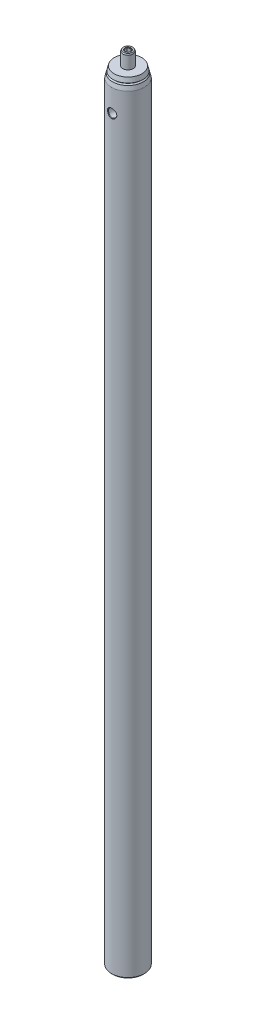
ISO-10303-21;
HEADER;
FILE_DESCRIPTION(('STEP AP214'),'2;1');
FILE_NAME('part.step','',(''),(''),'','','');
FILE_SCHEMA(('AUTOMOTIVE_DESIGN { 1 0 10303 214 1 1 1 1 }'));
ENDSEC;
DATA;
#1=APPLICATION_CONTEXT('core data for automotive mechanical design processes');
#2=APPLICATION_PROTOCOL_DEFINITION('international standard','automotive_design',2000,#1);
#3=PRODUCT_CONTEXT('',#1,'mechanical');
#4=PRODUCT('Part','Part','',(#3));
#5=PRODUCT_RELATED_PRODUCT_CATEGORY('part','',(#4));
#6=PRODUCT_DEFINITION_FORMATION('','',#4);
#7=PRODUCT_DEFINITION_CONTEXT('part definition',#1,'design');
#8=PRODUCT_DEFINITION('design','',#6,#7);
#9=PRODUCT_DEFINITION_SHAPE('','',#8);
#10=(LENGTH_UNIT() NAMED_UNIT(*) SI_UNIT(.MILLI.,.METRE.));
#11=(NAMED_UNIT(*) PLANE_ANGLE_UNIT() SI_UNIT($,.RADIAN.));
#12=(NAMED_UNIT(*) SI_UNIT($,.STERADIAN.) SOLID_ANGLE_UNIT());
#13=UNCERTAINTY_MEASURE_WITH_UNIT(LENGTH_MEASURE(1.E-05),#10,'distance_accuracy_value','');
#14=(GEOMETRIC_REPRESENTATION_CONTEXT(3) GLOBAL_UNCERTAINTY_ASSIGNED_CONTEXT((#13)) GLOBAL_UNIT_ASSIGNED_CONTEXT((#10,
#11,#12)) REPRESENTATION_CONTEXT('',''));
#15=CARTESIAN_POINT('',(0.,0.,0.));
#16=DIRECTION('',(0.,0.,1.));
#17=DIRECTION('',(1.,0.,0.));
#18=AXIS2_PLACEMENT_3D('',#15,#16,#17);
#19=CARTESIAN_POINT('',(0.,299.9994,0.));
#20=DIRECTION('',(0.,-1.,0.));
#21=DIRECTION('',(0.,0.,-1.));
#22=AXIS2_PLACEMENT_3D('',#19,#20,#21);
#23=PLANE('',#22);
#24=CARTESIAN_POINT('',(0.,299.9994,0.));
#25=DIRECTION('',(0.,-1.,0.));
#26=DIRECTION('',(0.,0.,-1.));
#27=AXIS2_PLACEMENT_3D('',#24,#25,#26);
#28=CIRCLE('',#27,1.90399999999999);
#29=CARTESIAN_POINT('',(0.,299.9994,-1.90399999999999));
#30=VERTEX_POINT('',#29);
#31=EDGE_CURVE('P0_E11',#30,#30,#28,.T.);
#32=ORIENTED_EDGE('',*,*,#31,.T.);
#33=EDGE_LOOP('',(#32));
#34=FACE_BOUND('',#33,.T.);
#35=CARTESIAN_POINT('',(0.,299.9994,0.));
#36=DIRECTION('',(0.,1.,0.));
#37=DIRECTION('',(0.,0.,1.));
#38=AXIS2_PLACEMENT_3D('',#35,#36,#37);
#39=CIRCLE('',#38,5.34669999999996);
#40=CARTESIAN_POINT('',(0.,299.9994,5.34669999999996));
#41=VERTEX_POINT('',#40);
#42=EDGE_CURVE('P0_E63',#41,#41,#39,.T.);
#43=ORIENTED_EDGE('',*,*,#42,.T.);
#44=EDGE_LOOP('',(#43));
#45=FACE_BOUND('',#44,.T.);
#46=ADVANCED_FACE('P0_F16',(#34,#45),#23,.F.);
#47=CARTESIAN_POINT('',(0.,298.289090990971,0.));
#48=DIRECTION('',(0.,-1.,0.));
#49=DIRECTION('',(0.,0.,-1.));
#50=AXIS2_PLACEMENT_3D('',#47,#48,#49);
#51=CONICAL_SURFACE('',#50,5.76886488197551,0.241998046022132);
#52=ORIENTED_EDGE('',*,*,#42,.F.);
#53=EDGE_LOOP('',(#52));
#54=FACE_BOUND('',#53,.T.);
#55=CARTESIAN_POINT('',(0.,298.289090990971,0.));
#56=DIRECTION('',(0.,1.,0.));
#57=DIRECTION('',(0.,0.,1.));
#58=AXIS2_PLACEMENT_3D('',#55,#56,#57);
#59=CIRCLE('',#58,5.76886488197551);
#60=CARTESIAN_POINT('',(0.,298.289090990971,5.76886488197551));
#61=VERTEX_POINT('',#60);
#62=EDGE_CURVE('P0_E60',#61,#61,#59,.T.);
#63=ORIENTED_EDGE('',*,*,#62,.T.);
#64=EDGE_LOOP('',(#63));
#65=FACE_BOUND('',#64,.T.);
#66=ADVANCED_FACE('P0_F214',(#54,#65),#51,.T.);
#67=CARTESIAN_POINT('',(0.,298.00042,0.));
#68=DIRECTION('',(0.,1.,0.));
#69=DIRECTION('',(0.,0.,1.));
#70=AXIS2_PLACEMENT_3D('',#67,#68,#69);
#71=CONICAL_SURFACE('',#70,5.49909999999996,0.75155561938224);
#72=ORIENTED_EDGE('',*,*,#62,.F.);
#73=EDGE_LOOP('',(#72));
#74=FACE_BOUND('',#73,.T.);
#75=CARTESIAN_POINT('',(0.,298.00042,0.));
#76=DIRECTION('',(0.,1.,0.));
#77=DIRECTION('',(0.,0.,1.));
#78=AXIS2_PLACEMENT_3D('',#75,#76,#77);
#79=CIRCLE('',#78,5.49909999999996);
#80=CARTESIAN_POINT('',(0.,298.00042,5.49909999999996));
#81=VERTEX_POINT('',#80);
#82=EDGE_CURVE('P0_E57',#81,#81,#79,.T.);
#83=ORIENTED_EDGE('',*,*,#82,.T.);
#84=EDGE_LOOP('',(#83));
#85=FACE_BOUND('',#84,.T.);
#86=ADVANCED_FACE('P0_F219',(#74,#85),#71,.T.);
#87=CARTESIAN_POINT('',(0.,297.586183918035,0.));
#88=DIRECTION('',(0.,-1.,0.));
#89=DIRECTION('',(0.,0.,-1.));
#90=AXIS2_PLACEMENT_3D('',#87,#88,#89);
#91=CONICAL_SURFACE('',#90,5.94236726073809,0.819240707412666);
#92=ORIENTED_EDGE('',*,*,#82,.F.);
#93=EDGE_LOOP('',(#92));
#94=FACE_BOUND('',#93,.T.);
#95=CARTESIAN_POINT('',(0.,297.586183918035,0.));
#96=DIRECTION('',(0.,1.,0.));
#97=DIRECTION('',(0.,0.,1.));
#98=AXIS2_PLACEMENT_3D('',#95,#96,#97);
#99=CIRCLE('',#98,5.94236726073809);
#100=CARTESIAN_POINT('',(0.,297.586183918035,5.94236726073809));
#101=VERTEX_POINT('',#100);
#102=EDGE_CURVE('P0_E54',#101,#101,#99,.T.);
#103=ORIENTED_EDGE('',*,*,#102,.T.);
#104=EDGE_LOOP('',(#103));
#105=FACE_BOUND('',#104,.T.);
#106=ADVANCED_FACE('P0_F228',(#94,#105),#91,.T.);
#107=CARTESIAN_POINT('',(0.,295.9862,0.));
#108=DIRECTION('',(0.,-1.,0.));
#109=DIRECTION('',(0.,0.,-1.));
#110=AXIS2_PLACEMENT_3D('',#107,#108,#109);
#111=CONICAL_SURFACE('',#110,6.33729999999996,0.241998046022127);
#112=ORIENTED_EDGE('',*,*,#102,.F.);
#113=EDGE_LOOP('',(#112));
#114=FACE_BOUND('',#113,.T.);
#115=CARTESIAN_POINT('',(0.,295.9862,0.));
#116=DIRECTION('',(0.,1.,0.));
#117=DIRECTION('',(0.,0.,1.));
#118=AXIS2_PLACEMENT_3D('',#115,#116,#117);
#119=CIRCLE('',#118,6.33729999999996);
#120=CARTESIAN_POINT('',(0.,295.9862,6.33729999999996));
#121=VERTEX_POINT('',#120);
#122=EDGE_CURVE('P0_E51',#121,#121,#119,.T.);
#123=ORIENTED_EDGE('',*,*,#122,.T.);
#124=EDGE_LOOP('',(#123));
#125=FACE_BOUND('',#124,.T.);
#126=ADVANCED_FACE('P0_F88',(#114,#125),#111,.T.);
#127=CARTESIAN_POINT('',(0.,299.9994,0.));
#128=DIRECTION('',(0.,1.,0.));
#129=DIRECTION('',(0.,0.,1.));
#130=AXIS2_PLACEMENT_3D('',#127,#128,#129);
#131=CYLINDRICAL_SURFACE('',#130,6.33729999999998);
#132=CARTESIAN_POINT('',(0.,285.571351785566,6.3373));
#133=CARTESIAN_POINT('',(0.0294399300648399,285.571335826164,6.33730404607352));
#134=CARTESIAN_POINT('',(0.058878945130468,285.572054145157,6.33707764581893));
#135=CARTESIAN_POINT('',(0.117621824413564,285.574934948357,6.33618719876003));
#136=CARTESIAN_POINT('',(0.146925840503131,285.577094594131,6.33552401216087));
#137=CARTESIAN_POINT('',(0.205337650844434,285.582829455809,6.33378438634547));
#138=CARTESIAN_POINT('',(0.234445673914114,285.586402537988,6.33270857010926));
#139=CARTESIAN_POINT('',(0.292405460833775,285.594935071,6.33016829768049));
#140=CARTESIAN_POINT('',(0.321257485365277,285.599892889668,6.32870429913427));
#141=CARTESIAN_POINT('',(0.378645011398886,285.611166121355,6.32541212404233));
#142=CARTESIAN_POINT('',(0.407180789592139,285.617480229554,6.32358429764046));
#143=CARTESIAN_POINT('',(0.463875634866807,285.631437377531,6.31958889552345));
#144=CARTESIAN_POINT('',(0.49203499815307,285.639079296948,6.31742160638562));
#145=CARTESIAN_POINT('',(0.547916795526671,285.655663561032,6.31277166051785));
#146=CARTESIAN_POINT('',(0.575639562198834,285.664604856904,6.31028925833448));
#147=CARTESIAN_POINT('',(0.630587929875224,285.6837594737,6.30503343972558));
#148=CARTESIAN_POINT('',(0.657813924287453,285.693971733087,6.30226026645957));
#149=CARTESIAN_POINT('',(0.711708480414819,285.715639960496,6.29644724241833));
#150=CARTESIAN_POINT('',(0.738377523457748,285.727094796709,6.29340763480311));
#151=CARTESIAN_POINT('',(0.791097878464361,285.751219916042,6.28708605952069));
#152=CARTESIAN_POINT('',(0.817149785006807,285.76388896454,6.28380433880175));
#153=CARTESIAN_POINT('',(0.868575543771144,285.790414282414,6.27702288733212));
#154=CARTESIAN_POINT('',(0.893950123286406,285.804269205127,6.27352340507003));
#155=CARTESIAN_POINT('',(0.943960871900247,285.833138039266,6.26633065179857));
#156=CARTESIAN_POINT('',(0.968597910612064,285.848150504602,6.26263762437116));
#157=CARTESIAN_POINT('',(1.01707325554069,285.879306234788,6.25508249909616));
#158=CARTESIAN_POINT('',(1.04091256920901,285.895447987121,6.25122062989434));
#159=CARTESIAN_POINT('',(1.08773198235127,285.928833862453,6.24335072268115));
#160=CARTESIAN_POINT('',(1.11071320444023,285.946076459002,6.23934289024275));
#161=CARTESIAN_POINT('',(1.15575658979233,285.981636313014,6.2312107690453));
#162=CARTESIAN_POINT('',(1.17781994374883,285.999952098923,6.22708664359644));
#163=CARTESIAN_POINT('',(1.22096551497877,286.037627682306,6.21872632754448));
#164=CARTESIAN_POINT('',(1.24204891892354,286.056986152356,6.21449028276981));
#165=CARTESIAN_POINT('',(1.28317150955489,286.096717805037,6.20600685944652));
#166=CARTESIAN_POINT('',(1.30321223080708,286.117089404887,6.20175950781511));
#167=CARTESIAN_POINT('',(1.34221596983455,286.158788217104,6.19335716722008));
#168=CARTESIAN_POINT('',(1.36118083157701,286.180113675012,6.18920202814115));
#169=CARTESIAN_POINT('',(1.39800144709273,286.223658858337,6.180991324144));
#170=CARTESIAN_POINT('',(1.41585895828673,286.245877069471,6.17693560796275));
#171=CARTESIAN_POINT('',(1.45043566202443,286.291149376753,6.16895620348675));
#172=CARTESIAN_POINT('',(1.46715657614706,286.314202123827,6.16503232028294));
#173=CARTESIAN_POINT('',(1.49943021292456,286.361084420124,6.15734229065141));
#174=CARTESIAN_POINT('',(1.51498466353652,286.384912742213,6.15357591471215));
#175=CARTESIAN_POINT('',(1.54489561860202,286.433287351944,6.14622841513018));
#176=CARTESIAN_POINT('',(1.55925388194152,286.457832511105,6.14264702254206));
#177=CARTESIAN_POINT('',(1.58674263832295,286.507581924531,6.1356965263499));
#178=CARTESIAN_POINT('',(1.59987492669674,286.532785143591,6.13232711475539));
#179=CARTESIAN_POINT('',(1.62488191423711,286.583791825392,6.1258277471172));
#180=CARTESIAN_POINT('',(1.63675842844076,286.609594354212,6.12269744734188));
#181=CARTESIAN_POINT('',(1.65922406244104,286.661740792,6.11670343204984));
#182=CARTESIAN_POINT('',(1.66981497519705,286.688083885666,6.11383934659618));
#183=CARTESIAN_POINT('',(1.68967964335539,286.74125257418,6.1084048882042));
#184=CARTESIAN_POINT('',(1.69895509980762,286.768077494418,6.10583413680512));
#185=CARTESIAN_POINT('',(1.71615916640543,286.822150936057,6.10101345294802));
#186=CARTESIAN_POINT('',(1.72408928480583,286.849398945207,6.09876316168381));
#187=CARTESIAN_POINT('',(1.73857307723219,286.904259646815,6.09461047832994));
#188=CARTESIAN_POINT('',(1.74512793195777,286.931872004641,6.09270778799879));
#189=CARTESIAN_POINT('',(1.75683178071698,286.987402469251,6.08927733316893));
#190=CARTESIAN_POINT('',(1.76198145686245,287.015320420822,6.08774938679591));
#191=CARTESIAN_POINT('',(1.77084554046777,287.071403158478,6.08509542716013));
#192=CARTESIAN_POINT('',(1.77455992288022,287.099567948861,6.08396942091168));
#193=CARTESIAN_POINT('',(1.78052484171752,287.156085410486,6.08214612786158));
#194=CARTESIAN_POINT('',(1.78277440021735,287.184438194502,6.08144912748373));
#195=CARTESIAN_POINT('',(1.78577903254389,287.241272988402,6.08051108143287));
#196=CARTESIAN_POINT('',(1.78653189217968,287.269755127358,6.08027071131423));
#197=CARTESIAN_POINT('',(1.78652142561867,287.326719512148,6.08027101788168));
#198=CARTESIAN_POINT('',(1.78575806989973,287.355201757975,6.08051170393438));
#199=CARTESIAN_POINT('',(1.78274505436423,287.412037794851,6.08144750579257));
#200=CARTESIAN_POINT('',(1.78049756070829,287.440391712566,6.08214195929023));
#201=CARTESIAN_POINT('',(1.77454464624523,287.496912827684,6.08395846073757));
#202=CARTESIAN_POINT('',(1.77084019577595,287.525080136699,6.08508022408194));
#203=CARTESIAN_POINT('',(1.76200373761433,287.58116972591,6.08772409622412));
#204=CARTESIAN_POINT('',(1.75687176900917,287.609092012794,6.08924619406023));
#205=CARTESIAN_POINT('',(1.74520976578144,287.664633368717,6.09266372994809));
#206=CARTESIAN_POINT('',(1.73867907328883,287.692252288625,6.09455934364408));
#207=CARTESIAN_POINT('',(1.72424904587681,287.747128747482,6.0986969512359));
#208=CARTESIAN_POINT('',(1.71634855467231,287.774385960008,6.10093923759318));
#209=CARTESIAN_POINT('',(1.69920811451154,287.828480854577,6.10574330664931));
#210=CARTESIAN_POINT('',(1.68996667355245,287.855318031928,6.10830544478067));
#211=CARTESIAN_POINT('',(1.67017337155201,287.908514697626,6.11372238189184));
#212=CARTESIAN_POINT('',(1.65961981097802,287.934873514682,6.11657755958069));
#213=CARTESIAN_POINT('',(1.63723117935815,287.98705528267,6.12255377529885));
#214=CARTESIAN_POINT('',(1.62539429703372,288.012877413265,6.12567518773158));
#215=CARTESIAN_POINT('',(1.60046784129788,288.06392760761,6.13215710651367));
#216=CARTESIAN_POINT('',(1.58737641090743,288.089154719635,6.13551796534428));
#217=CARTESIAN_POINT('',(1.55996960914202,288.138956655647,6.14245199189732));
#218=CARTESIAN_POINT('',(1.54565237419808,288.163530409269,6.14602548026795));
#219=CARTESIAN_POINT('',(1.51582269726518,288.211967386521,6.15335811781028));
#220=CARTESIAN_POINT('',(1.50030840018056,288.235829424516,6.15711755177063));
#221=CARTESIAN_POINT('',(1.46811324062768,288.282784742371,6.16479495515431));
#222=CARTESIAN_POINT('',(1.45143052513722,288.305876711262,6.1687131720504));
#223=CARTESIAN_POINT('',(1.41692747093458,288.351233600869,6.17668281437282));
#224=CARTESIAN_POINT('',(1.39910525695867,288.373497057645,6.18073445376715));
#225=CARTESIAN_POINT('',(1.36235107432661,288.417138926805,6.18893888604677));
#226=CARTESIAN_POINT('',(1.34341716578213,288.438515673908,6.19309184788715));
#227=CARTESIAN_POINT('',(1.30447161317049,288.480325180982,6.20149204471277));
#228=CARTESIAN_POINT('',(1.28445791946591,288.500755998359,6.20573944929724));
#229=CARTESIAN_POINT('',(1.24338256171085,288.540605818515,6.21422472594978));
#230=CARTESIAN_POINT('',(1.22231929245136,288.560023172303,6.21846257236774));
#231=CARTESIAN_POINT('',(1.17920582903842,288.597807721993,6.22682733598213));
#232=CARTESIAN_POINT('',(1.15715450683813,288.616173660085,6.23095411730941));
#233=CARTESIAN_POINT('',(1.11212941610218,288.651827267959,6.23909234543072));
#234=CARTESIAN_POINT('',(1.08915449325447,288.669113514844,6.2431036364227));
#235=CARTESIAN_POINT('',(1.04234247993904,288.702580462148,6.25098116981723));
#236=CARTESIAN_POINT('',(1.01850428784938,288.718759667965,6.25484721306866));
#237=CARTESIAN_POINT('',(0.970027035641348,288.749984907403,6.26241131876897));
#238=CARTESIAN_POINT('',(0.945386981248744,288.765029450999,6.26610915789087));
#239=CARTESIAN_POINT('',(0.89536696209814,288.79395772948,6.27331208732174));
#240=CARTESIAN_POINT('',(0.869986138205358,288.807840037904,6.27681693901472));
#241=CARTESIAN_POINT('',(0.81854559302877,288.834416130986,6.28360960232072));
#242=CARTESIAN_POINT('',(0.792485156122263,288.847108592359,6.2868971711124));
#243=CARTESIAN_POINT('',(0.739746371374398,288.871277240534,6.29323083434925));
#244=CARTESIAN_POINT('',(0.713067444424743,288.882752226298,6.2962766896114));
#245=CARTESIAN_POINT('',(0.659152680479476,288.90445815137,6.30210251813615));
#246=CARTESIAN_POINT('',(0.631916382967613,288.914688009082,6.30488225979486));
#247=CARTESIAN_POINT('',(0.57694789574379,288.933875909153,6.31015143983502));
#248=CARTESIAN_POINT('',(0.549215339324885,288.94283296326,6.31264065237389));
#249=CARTESIAN_POINT('',(0.493315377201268,288.959447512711,6.31730435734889));
#250=CARTESIAN_POINT('',(0.465147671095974,288.967104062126,6.31947862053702));
#251=CARTESIAN_POINT('',(0.408438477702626,288.981089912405,6.32348801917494));
#252=CARTESIAN_POINT('',(0.37989673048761,288.987418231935,6.32532290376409));
#253=CARTESIAN_POINT('',(0.322500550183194,288.99872000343,6.32862915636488));
#254=CARTESIAN_POINT('',(0.293645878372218,289.003692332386,6.33010022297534));
#255=CARTESIAN_POINT('',(0.235684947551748,289.01225464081,6.33265448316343));
#256=CARTESIAN_POINT('',(0.206578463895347,289.015843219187,6.33373728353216));
#257=CARTESIAN_POINT('',(0.148175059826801,289.021610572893,6.33549068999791));
#258=CARTESIAN_POINT('',(0.118877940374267,289.023787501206,6.33616075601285));
#259=CARTESIAN_POINT('',(0.06015421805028,289.026704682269,6.33706445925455));
#260=CARTESIAN_POINT('',(0.0307274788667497,289.027442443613,6.33729733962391));
#261=CARTESIAN_POINT('',(-0.0281314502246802,289.027453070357,6.33730239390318));
#262=CARTESIAN_POINT('',(-0.0575636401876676,289.026725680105,6.33707448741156));
#263=CARTESIAN_POINT('',(-0.116308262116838,289.023827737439,6.33618067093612));
#264=CARTESIAN_POINT('',(-0.145620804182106,289.021659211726,6.33551537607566));
#265=CARTESIAN_POINT('',(-0.204063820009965,289.015908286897,6.33377147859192));
#266=CARTESIAN_POINT('',(-0.233194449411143,289.01232733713,6.33269329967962));
#267=CARTESIAN_POINT('',(-0.291211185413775,289.003780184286,6.33014820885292));
#268=CARTESIAN_POINT('',(-0.320097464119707,288.998815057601,6.32868159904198));
#269=CARTESIAN_POINT('',(-0.377563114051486,288.987528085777,6.32538416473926));
#270=CARTESIAN_POINT('',(-0.406142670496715,288.981207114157,6.32355357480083));
#271=CARTESIAN_POINT('',(-0.462932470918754,288.967236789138,6.3195526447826));
#272=CARTESIAN_POINT('',(-0.491142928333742,288.959588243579,6.31738251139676));
#273=CARTESIAN_POINT('',(-0.547132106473,288.942990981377,6.31272692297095));
#274=CARTESIAN_POINT('',(-0.574911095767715,288.934043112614,6.31024167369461));
#275=CARTESIAN_POINT('',(-0.629974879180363,288.914875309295,6.3049802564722));
#276=CARTESIAN_POINT('',(-0.657260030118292,288.904656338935,6.30220430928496));
#277=CARTESIAN_POINT('',(-0.71127364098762,288.882974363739,6.29638588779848));
#278=CARTESIAN_POINT('',(-0.738002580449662,288.87151248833,6.29334365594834));
#279=CARTESIAN_POINT('',(-0.790841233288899,288.847372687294,6.28701704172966));
#280=CARTESIAN_POINT('',(-0.816951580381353,288.834696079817,6.28373292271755));
#281=CARTESIAN_POINT('',(-0.868490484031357,288.808154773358,6.27694694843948));
#282=CARTESIAN_POINT('',(-0.893919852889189,288.794291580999,6.27344537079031));
#283=CARTESIAN_POINT('',(-0.944034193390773,288.765405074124,6.26624876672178));
#284=CARTESIAN_POINT('',(-0.968720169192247,288.750383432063,6.26255402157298));
#285=CARTESIAN_POINT('',(-1.01728516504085,288.719207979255,6.25499587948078));
#286=CARTESIAN_POINT('',(-1.041165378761,288.703055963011,6.25113275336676));
#287=CARTESIAN_POINT('',(-1.08805606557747,288.669647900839,6.24326080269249));
#288=CARTESIAN_POINT('',(-1.11106789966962,288.65239370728,6.23925222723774));
#289=CARTESIAN_POINT('',(-1.15615992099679,288.616808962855,6.2311192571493));
#290=CARTESIAN_POINT('',(-1.17824158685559,288.598480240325,6.22699506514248));
#291=CARTESIAN_POINT('',(-1.22140823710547,288.560776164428,6.21863501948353));
#292=CARTESIAN_POINT('',(-1.24249474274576,288.541402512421,6.21439935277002));
#293=CARTESIAN_POINT('',(-1.28361269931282,288.501636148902,6.20591742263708));
#294=CARTESIAN_POINT('',(-1.30364583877,288.481245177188,6.20167118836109));
#295=CARTESIAN_POINT('',(-1.34263154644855,288.439503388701,6.19327195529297));
#296=CARTESIAN_POINT('',(-1.36158588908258,288.418154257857,6.18911881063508));
#297=CARTESIAN_POINT('',(-1.39838257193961,288.374557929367,6.18091254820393));
#298=CARTESIAN_POINT('',(-1.41622659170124,288.352312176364,6.17685928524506));
#299=CARTESIAN_POINT('',(-1.45077430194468,288.306982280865,6.16888519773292));
#300=CARTESIAN_POINT('',(-1.4674796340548,288.283899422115,6.16496418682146));
#301=CARTESIAN_POINT('',(-1.49972072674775,288.23695545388,6.15728016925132));
#302=CARTESIAN_POINT('',(-1.51525814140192,288.213095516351,6.15351694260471));
#303=CARTESIAN_POINT('',(-1.54513433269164,288.164657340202,6.14617589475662));
#304=CARTESIAN_POINT('',(-1.55947480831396,288.140080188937,6.14259781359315));
#305=CARTESIAN_POINT('',(-1.58692795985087,288.090267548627,6.13565397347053));
#306=CARTESIAN_POINT('',(-1.60004239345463,288.065033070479,6.13228791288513));
#307=CARTESIAN_POINT('',(-1.62501430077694,288.013965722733,6.12579516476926));
#308=CARTESIAN_POINT('',(-1.63687358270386,287.98813378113,6.12266813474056));
#309=CARTESIAN_POINT('',(-1.65930603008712,287.935931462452,6.11668046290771));
#310=CARTESIAN_POINT('',(-1.66988102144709,287.909561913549,6.11381944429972));
#311=CARTESIAN_POINT('',(-1.68971576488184,287.856344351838,6.1083908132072));
#312=CARTESIAN_POINT('',(-1.69897730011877,287.829497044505,6.10582280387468));
#313=CARTESIAN_POINT('',(-1.71615607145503,287.775383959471,6.10100719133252));
#314=CARTESIAN_POINT('',(-1.72407495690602,287.748118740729,6.09875919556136));
#315=CARTESIAN_POINT('',(-1.73853945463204,287.693229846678,6.09461058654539));
#316=CARTESIAN_POINT('',(-1.74508645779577,287.665606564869,6.09270962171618));
#317=CARTESIAN_POINT('',(-1.7567783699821,287.610061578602,6.08928200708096));
#318=CARTESIAN_POINT('',(-1.76192425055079,287.58214009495,6.0877550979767));
#319=CARTESIAN_POINT('',(-1.77078516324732,287.526058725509,6.08510249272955));
#320=CARTESIAN_POINT('',(-1.77450054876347,287.497898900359,6.08397669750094));
#321=CARTESIAN_POINT('',(-1.78047228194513,287.441400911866,6.08215307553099));
#322=CARTESIAN_POINT('',(-1.78272812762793,287.413062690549,6.08145539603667));
#323=CARTESIAN_POINT('',(-1.78575147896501,287.356267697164,6.08051493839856));
#324=CARTESIAN_POINT('',(-1.78651735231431,287.327810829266,6.08027265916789));
#325=CARTESIAN_POINT('',(-1.78653677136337,287.270902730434,6.08026883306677));
#326=CARTESIAN_POINT('',(-1.7857906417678,287.242451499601,6.0805071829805));
#327=CARTESIAN_POINT('',(-1.7828130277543,287.18567775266,6.08143863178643));
#328=CARTESIAN_POINT('',(-1.78058377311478,287.157355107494,6.08213104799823));
#329=CARTESIAN_POINT('',(-1.77466841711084,287.100896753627,6.08394357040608));
#330=CARTESIAN_POINT('',(-1.77098334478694,287.072760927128,6.08506337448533));
#331=CARTESIAN_POINT('',(-1.76218590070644,287.016734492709,6.08770347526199));
#332=CARTESIAN_POINT('',(-1.75707361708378,286.988843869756,6.08922374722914));
#333=CARTESIAN_POINT('',(-1.74545068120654,286.933365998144,6.09263775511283));
#334=CARTESIAN_POINT('',(-1.73893940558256,286.905778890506,6.09453165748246));
#335=CARTESIAN_POINT('',(-1.72454728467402,286.850966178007,6.09866596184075));
#336=CARTESIAN_POINT('',(-1.71666529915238,286.823740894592,6.10090665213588));
#337=CARTESIAN_POINT('',(-1.69956034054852,286.769709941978,6.1057076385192));
#338=CARTESIAN_POINT('',(-1.69033586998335,286.742904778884,6.10826829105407));
#339=CARTESIAN_POINT('',(-1.67057437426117,286.689772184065,6.11368235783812));
#340=CARTESIAN_POINT('',(-1.66003562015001,286.663445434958,6.11653615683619));
#341=CARTESIAN_POINT('',(-1.63767386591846,286.611327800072,6.12250970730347));
#342=CARTESIAN_POINT('',(-1.62584899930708,286.585537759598,6.12562984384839));
#343=CARTESIAN_POINT('',(-1.60094323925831,286.534551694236,6.13210929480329));
#344=CARTESIAN_POINT('',(-1.58786040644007,286.509356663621,6.13546897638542));
#345=CARTESIAN_POINT('',(-1.56046686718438,286.459618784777,6.14240072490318));
#346=CARTESIAN_POINT('',(-1.54615418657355,286.435077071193,6.14597313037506));
#347=CARTESIAN_POINT('',(-1.51632908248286,286.386704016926,6.15330367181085));
#348=CARTESIAN_POINT('',(-1.50081466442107,286.362873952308,6.15706211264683));
#349=CARTESIAN_POINT('',(-1.46861415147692,286.3159823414,6.16473759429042));
#350=CARTESIAN_POINT('',(-1.45192603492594,286.292922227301,6.16865490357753));
#351=CARTESIAN_POINT('',(-1.41740639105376,286.247628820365,6.17662278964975));
#352=CARTESIAN_POINT('',(-1.39957279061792,286.22539714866,6.18067360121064));
#353=CARTESIAN_POINT('',(-1.36278974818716,286.18181825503,6.18887643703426));
#354=CARTESIAN_POINT('',(-1.34383814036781,286.160472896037,6.19302864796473));
#355=CARTESIAN_POINT('',(-1.3048493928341,286.118726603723,6.20142739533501));
#356=CARTESIAN_POINT('',(-1.28480994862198,286.098327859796,6.20567411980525));
#357=CARTESIAN_POINT('',(-1.24367802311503,286.058537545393,6.21415825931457));
#358=CARTESIAN_POINT('',(-1.22258362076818,286.039147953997,6.21839564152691));
#359=CARTESIAN_POINT('',(-1.17940611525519,286.001409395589,6.22675999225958));
#360=CARTESIAN_POINT('',(-1.15732157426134,285.983062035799,6.23088678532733));
#361=CARTESIAN_POINT('',(-1.11222765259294,285.947438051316,6.23902550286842));
#362=CARTESIAN_POINT('',(-1.08921687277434,285.930163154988,6.24303723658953));
#363=CARTESIAN_POINT('',(-1.04233151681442,285.896711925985,6.25091606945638));
#364=CARTESIAN_POINT('',(-1.01845565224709,285.880537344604,6.25478293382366));
#365=CARTESIAN_POINT('',(-0.969901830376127,285.849315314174,6.26234904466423));
#366=CARTESIAN_POINT('',(-0.945222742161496,285.834269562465,6.26604803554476));
#367=CARTESIAN_POINT('',(-0.895123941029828,285.805333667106,6.27325357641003));
#368=CARTESIAN_POINT('',(-0.869703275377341,285.791445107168,6.27675986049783));
#369=CARTESIAN_POINT('',(-0.818182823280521,285.764852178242,6.28355564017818));
#370=CARTESIAN_POINT('',(-0.792082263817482,285.752149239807,6.28684487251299));
#371=CARTESIAN_POINT('',(-0.739263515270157,285.727956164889,6.29318205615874));
#372=CARTESIAN_POINT('',(-0.712544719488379,285.716467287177,6.29622975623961));
#373=CARTESIAN_POINT('',(-0.658551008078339,285.694730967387,6.30205940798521));
#374=CARTESIAN_POINT('',(-0.631275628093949,285.684484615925,6.30484112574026));
#375=CARTESIAN_POINT('',(-0.576230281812,285.665261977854,6.31011433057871));
#376=CARTESIAN_POINT('',(-0.548459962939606,285.656286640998,6.31260560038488));
#377=CARTESIAN_POINT('',(-0.492486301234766,285.639634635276,6.31727343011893));
#378=CARTESIAN_POINT('',(-0.464282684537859,285.631958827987,6.31944978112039));
#379=CARTESIAN_POINT('',(-0.407504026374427,285.617934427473,6.32346330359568));
#380=CARTESIAN_POINT('',(-0.378928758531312,285.611586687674,6.32530025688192));
#381=CARTESIAN_POINT('',(-0.321468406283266,285.600246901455,6.32861052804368));
#382=CARTESIAN_POINT('',(-0.29258311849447,285.595255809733,6.33008358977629));
#383=CARTESIAN_POINT('',(-0.23456443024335,285.586657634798,6.33264167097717));
#384=CARTESIAN_POINT('',(-0.205430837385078,285.583051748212,6.33372635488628));
#385=CARTESIAN_POINT('',(-0.146976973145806,285.577252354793,6.335483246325));
#386=CARTESIAN_POINT('',(-0.117656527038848,285.575060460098,6.33615498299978));
#387=CARTESIAN_POINT('',(-0.0588914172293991,285.572116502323,6.33706186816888));
#388=CARTESIAN_POINT('',(-0.0294466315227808,285.571366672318,6.33729633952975));
#389=CARTESIAN_POINT('',(0.,285.571351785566,6.3373));
#390=B_SPLINE_CURVE_WITH_KNOTS('',3,(#132,#133,#134,#135,#136,#137,#138,#139,#140,#141,#142,
#143,#144,#145,#146,#147,#148,#149,#150,#151,#152,#153,#154,#155,#156,#157,#158,#159,#160,#161,
#162,#163,#164,#165,#166,#167,#168,#169,#170,#171,#172,#173,#174,#175,#176,#177,#178,#179,#180,
#181,#182,#183,#184,#185,#186,#187,#188,#189,#190,#191,#192,#193,#194,#195,#196,#197,#198,#199,
#200,#201,#202,#203,#204,#205,#206,#207,#208,#209,#210,#211,#212,#213,#214,#215,#216,#217,#218,
#219,#220,#221,#222,#223,#224,#225,#226,#227,#228,#229,#230,#231,#232,#233,#234,#235,#236,#237,
#238,#239,#240,#241,#242,#243,#244,#245,#246,#247,#248,#249,#250,#251,#252,#253,#254,#255,#256,
#257,#258,#259,#260,#261,#262,#263,#264,#265,#266,#267,#268,#269,#270,#271,#272,#273,#274,#275,
#276,#277,#278,#279,#280,#281,#282,#283,#284,#285,#286,#287,#288,#289,#290,#291,#292,#293,#294,
#295,#296,#297,#298,#299,#300,#301,#302,#303,#304,#305,#306,#307,#308,#309,#310,#311,#312,#313,
#314,#315,#316,#317,#318,#319,#320,#321,#322,#323,#324,#325,#326,#327,#328,#329,#330,#331,#332,
#333,#334,#335,#336,#337,#338,#339,#340,#341,#342,#343,#344,#345,#346,#347,#348,#349,#350,#351,
#352,#353,#354,#355,#356,#357,#358,#359,#360,#361,#362,#363,#364,#365,#366,#367,#368,#369,#370,
#371,#372,#373,#374,#375,#376,#377,#378,#379,#380,#381,#382,#383,#384,#385,#386,#387,#388,#389),
.UNSPECIFIED.,.F.,.F.,(4,2,2,2,2,2,2,2,2,2,2,2,2,2,2,2,2,2,2,2,2,2,2,2,2,2,2,2,2,2,2,2,2,2,2,2,
2,2,2,2,2,2,2,2,2,2,2,2,2,2,2,2,2,2,2,2,2,2,2,2,2,2,2,2,2,2,2,2,2,2,2,2,2,2,2,2,2,2,2,2,2,2,2,2,
2,2,2,2,2,2,2,2,2,2,2,2,2,2,2,2,2,2,2,2,2,2,2,2,2,2,2,2,2,2,2,2,2,2,2,2,2,2,2,2,2,2,2,2,4),(0.,
0.0883078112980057,0.176442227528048,0.264444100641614,0.352342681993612,0.440157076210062,
0.52789773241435,0.615567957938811,0.703165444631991,0.790683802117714,0.878114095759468,
0.965446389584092,1.0526712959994,1.13978153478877,1.22677350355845,1.31364886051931,
1.40041611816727,1.48705183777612,1.57353427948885,1.65987575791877,1.74608340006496,
1.83216070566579,1.91810912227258,2.00392963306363,2.08962435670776,2.17519815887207,
2.26066027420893,2.34602593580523,2.43131800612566,2.51656859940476,2.60182068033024,
2.6871296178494,2.77256466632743,2.85800137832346,2.94331366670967,3.02856923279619,
3.11382246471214,3.19911588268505,3.28448165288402,3.36994314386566,3.45551650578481,
3.54121225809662,3.62703687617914,3.71299437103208,3.79908785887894,3.88532111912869,
3.97170013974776,4.05823464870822,4.14493962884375,4.23178154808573,4.31872527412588,
4.40578126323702,4.49295255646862,4.58023639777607,4.6676258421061,4.75511135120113,
4.84268237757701,4.93032893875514,5.01804318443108,5.10582095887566,5.19366335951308,
5.28157829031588,5.36958200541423,5.4577006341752,5.54597167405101,5.63425811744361,
5.72242066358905,5.8104929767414,5.89849699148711,5.98644447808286,6.07433863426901,
6.16217569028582,6.24994651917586,6.33763824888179,6.42523587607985,6.51272388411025,
6.6000878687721,6.68731617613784,6.77440155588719,6.86134283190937,6.94814658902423,
7.03480667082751,7.12131982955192,7.20769877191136,7.29395042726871,7.38007753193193,
7.46608022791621,7.55195767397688,7.63770966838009,7.72333828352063,7.80884951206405,
7.89425492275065,7.97957332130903,8.06483240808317,8.15007041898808,8.23533773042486,
8.32069840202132,8.40604074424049,8.49125506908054,8.57640926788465,8.66155820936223,
8.7467451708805,8.8320033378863,8.9173573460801,9.00282484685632,9.08841808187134,
9.17414545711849,9.26001311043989,9.3460264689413,9.43219179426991,9.51851771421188,
9.60501673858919,9.69170675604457,9.77856083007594,9.86554539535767,9.95266668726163,
10.0399235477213,10.1273090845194,10.2148123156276,10.3024197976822,10.3901172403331,
10.4778911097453,10.5657302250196,10.6536273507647,10.7415807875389,10.8295959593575,
10.9176869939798,11.0058782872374,11.0942060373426),.UNSPECIFIED.);
#391=CARTESIAN_POINT('',(0.,285.571351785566,6.3373));
#392=VERTEX_POINT('',#391);
#393=EDGE_CURVE('P0_E134',#392,#392,#390,.F.);
#394=ORIENTED_EDGE('',*,*,#393,.T.);
#395=EDGE_LOOP('',(#394));
#396=FACE_BOUND('',#395,.T.);
#397=CARTESIAN_POINT('',(0.,289.027448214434,-6.33729999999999));
#398=CARTESIAN_POINT('',(0.0294399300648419,289.027464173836,-6.33730404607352));
#399=CARTESIAN_POINT('',(0.0588789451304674,289.026745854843,-6.33707764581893));
#400=CARTESIAN_POINT('',(0.117621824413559,289.023865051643,-6.33618719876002));
#401=CARTESIAN_POINT('',(0.146925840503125,289.021705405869,-6.33552401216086));
#402=CARTESIAN_POINT('',(0.205337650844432,289.015970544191,-6.33378438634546));
#403=CARTESIAN_POINT('',(0.234445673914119,289.012397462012,-6.33270857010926));
#404=CARTESIAN_POINT('',(0.292405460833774,289.003864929,-6.33016829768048));
#405=CARTESIAN_POINT('',(0.321257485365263,288.998907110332,-6.32870429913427));
#406=CARTESIAN_POINT('',(0.378645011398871,288.987633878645,-6.32541212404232));
#407=CARTESIAN_POINT('',(0.407180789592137,288.981319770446,-6.32358429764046));
#408=CARTESIAN_POINT('',(0.463875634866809,288.967362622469,-6.31958889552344));
#409=CARTESIAN_POINT('',(0.492034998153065,288.959720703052,-6.31742160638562));
#410=CARTESIAN_POINT('',(0.547916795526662,288.943136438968,-6.31277166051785));
#411=CARTESIAN_POINT('',(0.575639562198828,288.934195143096,-6.31028925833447));
#412=CARTESIAN_POINT('',(0.630587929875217,288.9150405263,-6.30503343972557));
#413=CARTESIAN_POINT('',(0.65781392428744,288.904828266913,-6.30226026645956));
#414=CARTESIAN_POINT('',(0.711708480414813,288.883160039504,-6.29644724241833));
#415=CARTESIAN_POINT('',(0.738377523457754,288.871705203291,-6.29340763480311));
#416=CARTESIAN_POINT('',(0.791097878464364,288.847580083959,-6.28708605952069));
#417=CARTESIAN_POINT('',(0.817149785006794,288.83491103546,-6.28380433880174));
#418=CARTESIAN_POINT('',(0.868575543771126,288.808385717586,-6.27702288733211));
#419=CARTESIAN_POINT('',(0.893950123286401,288.794530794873,-6.27352340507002));
#420=CARTESIAN_POINT('',(0.943960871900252,288.765661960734,-6.26633065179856));
#421=CARTESIAN_POINT('',(0.968597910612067,288.750649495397,-6.26263762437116));
#422=CARTESIAN_POINT('',(1.01707325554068,288.719493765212,-6.25508249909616));
#423=CARTESIAN_POINT('',(1.04091256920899,288.703352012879,-6.25122062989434));
#424=CARTESIAN_POINT('',(1.08773198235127,288.669966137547,-6.24335072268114));
#425=CARTESIAN_POINT('',(1.11071320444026,288.652723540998,-6.23934289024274));
#426=CARTESIAN_POINT('',(1.15575658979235,288.617163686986,-6.23121076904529));
#427=CARTESIAN_POINT('',(1.1778199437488,288.598847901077,-6.22708664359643));
#428=CARTESIAN_POINT('',(1.22096551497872,288.561172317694,-6.21872632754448));
#429=CARTESIAN_POINT('',(1.24204891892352,288.541813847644,-6.21449028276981));
#430=CARTESIAN_POINT('',(1.28317150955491,288.502082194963,-6.20600685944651));
#431=CARTESIAN_POINT('',(1.3032122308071,288.481710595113,-6.2017595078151));
#432=CARTESIAN_POINT('',(1.34221596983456,288.440011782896,-6.19335716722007));
#433=CARTESIAN_POINT('',(1.36118083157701,288.418686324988,-6.18920202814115));
#434=CARTESIAN_POINT('',(1.39800144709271,288.375141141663,-6.18099132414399));
#435=CARTESIAN_POINT('',(1.41585895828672,288.352922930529,-6.17693560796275));
#436=CARTESIAN_POINT('',(1.45043566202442,288.307650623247,-6.16895620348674));
#437=CARTESIAN_POINT('',(1.46715657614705,288.284597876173,-6.16503232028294));
#438=CARTESIAN_POINT('',(1.49943021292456,288.237715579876,-6.1573422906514));
#439=CARTESIAN_POINT('',(1.51498466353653,288.213887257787,-6.15357591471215));
#440=CARTESIAN_POINT('',(1.54489561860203,288.165512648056,-6.14622841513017));
#441=CARTESIAN_POINT('',(1.55925388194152,288.140967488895,-6.14264702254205));
#442=CARTESIAN_POINT('',(1.58674263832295,288.091218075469,-6.13569652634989));
#443=CARTESIAN_POINT('',(1.59987492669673,288.066014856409,-6.13232711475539));
#444=CARTESIAN_POINT('',(1.62488191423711,288.015008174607,-6.1258277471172));
#445=CARTESIAN_POINT('',(1.63675842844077,287.989205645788,-6.12269744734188));
#446=CARTESIAN_POINT('',(1.65922406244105,287.937059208,-6.11670343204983));
#447=CARTESIAN_POINT('',(1.66981497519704,287.910716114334,-6.11383934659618));
#448=CARTESIAN_POINT('',(1.68967964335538,287.85754742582,-6.1084048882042));
#449=CARTESIAN_POINT('',(1.69895509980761,287.830722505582,-6.10583413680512));
#450=CARTESIAN_POINT('',(1.71615916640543,287.776649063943,-6.10101345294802));
#451=CARTESIAN_POINT('',(1.72408928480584,287.749401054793,-6.0987631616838));
#452=CARTESIAN_POINT('',(1.7385730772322,287.694540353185,-6.09461047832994));
#453=CARTESIAN_POINT('',(1.74512793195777,287.666927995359,-6.09270778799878));
#454=CARTESIAN_POINT('',(1.75683178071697,287.611397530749,-6.08927733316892));
#455=CARTESIAN_POINT('',(1.76198145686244,287.583479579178,-6.08774938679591));
#456=CARTESIAN_POINT('',(1.77084554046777,287.527396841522,-6.08509542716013));
#457=CARTESIAN_POINT('',(1.77455992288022,287.499232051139,-6.08396942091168));
#458=CARTESIAN_POINT('',(1.78052484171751,287.442714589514,-6.08214612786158));
#459=CARTESIAN_POINT('',(1.78277440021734,287.414361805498,-6.08144912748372));
#460=CARTESIAN_POINT('',(1.78577903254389,287.357527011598,-6.08051108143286));
#461=CARTESIAN_POINT('',(1.78653189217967,287.329044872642,-6.08027071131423));
#462=CARTESIAN_POINT('',(1.78652142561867,287.272080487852,-6.08027101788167));
#463=CARTESIAN_POINT('',(1.78575806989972,287.243598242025,-6.08051170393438));
#464=CARTESIAN_POINT('',(1.78274505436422,287.186762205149,-6.08144750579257));
#465=CARTESIAN_POINT('',(1.78049756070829,287.158408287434,-6.08214195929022));
#466=CARTESIAN_POINT('',(1.77454464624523,287.101887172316,-6.08395846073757));
#467=CARTESIAN_POINT('',(1.77084019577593,287.073719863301,-6.08508022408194));
#468=CARTESIAN_POINT('',(1.76200373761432,287.01763027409,-6.08772409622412));
#469=CARTESIAN_POINT('',(1.75687176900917,286.989707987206,-6.08924619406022));
#470=CARTESIAN_POINT('',(1.74520976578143,286.934166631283,-6.09266372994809));
#471=CARTESIAN_POINT('',(1.7386790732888,286.906547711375,-6.09455934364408));
#472=CARTESIAN_POINT('',(1.72424904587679,286.851671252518,-6.0986969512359));
#473=CARTESIAN_POINT('',(1.71634855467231,286.824414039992,-6.10093923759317));
#474=CARTESIAN_POINT('',(1.69920811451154,286.770319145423,-6.1057433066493));
#475=CARTESIAN_POINT('',(1.68996667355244,286.743481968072,-6.10830544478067));
#476=CARTESIAN_POINT('',(1.67017337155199,286.690285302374,-6.11372238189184));
#477=CARTESIAN_POINT('',(1.65961981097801,286.663926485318,-6.11657755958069));
#478=CARTESIAN_POINT('',(1.63723117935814,286.61174471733,-6.12255377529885));
#479=CARTESIAN_POINT('',(1.62539429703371,286.585922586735,-6.12567518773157));
#480=CARTESIAN_POINT('',(1.60046784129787,286.53487239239,-6.13215710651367));
#481=CARTESIAN_POINT('',(1.58737641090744,286.509645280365,-6.13551796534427));
#482=CARTESIAN_POINT('',(1.55996960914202,286.459843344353,-6.14245199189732));
#483=CARTESIAN_POINT('',(1.54565237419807,286.435269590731,-6.14602548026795));
#484=CARTESIAN_POINT('',(1.51582269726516,286.386832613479,-6.15335811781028));
#485=CARTESIAN_POINT('',(1.50030840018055,286.362970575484,-6.15711755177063));
#486=CARTESIAN_POINT('',(1.46811324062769,286.316015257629,-6.16479495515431));
#487=CARTESIAN_POINT('',(1.45143052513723,286.292923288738,-6.16871317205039));
#488=CARTESIAN_POINT('',(1.41692747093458,286.247566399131,-6.17668281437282));
#489=CARTESIAN_POINT('',(1.39910525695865,286.225302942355,-6.18073445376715));
#490=CARTESIAN_POINT('',(1.3623510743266,286.181661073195,-6.18893888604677));
#491=CARTESIAN_POINT('',(1.34341716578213,286.160284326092,-6.19309184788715));
#492=CARTESIAN_POINT('',(1.30447161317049,286.118474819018,-6.20149204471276));
#493=CARTESIAN_POINT('',(1.28445791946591,286.098044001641,-6.20573944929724));
#494=CARTESIAN_POINT('',(1.24338256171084,286.058194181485,-6.21422472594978));
#495=CARTESIAN_POINT('',(1.22231929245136,286.038776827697,-6.21846257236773));
#496=CARTESIAN_POINT('',(1.17920582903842,286.000992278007,-6.22682733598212));
#497=CARTESIAN_POINT('',(1.15715450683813,285.982626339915,-6.2309541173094));
#498=CARTESIAN_POINT('',(1.11212941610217,285.946972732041,-6.23909234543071));
#499=CARTESIAN_POINT('',(1.08915449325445,285.929686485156,-6.2431036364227));
#500=CARTESIAN_POINT('',(1.04234247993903,285.896219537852,-6.25098116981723));
#501=CARTESIAN_POINT('',(1.01850428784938,285.880040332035,-6.25484721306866));
#502=CARTESIAN_POINT('',(0.970027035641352,285.848815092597,-6.26241131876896));
#503=CARTESIAN_POINT('',(0.94538698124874,285.833770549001,-6.26610915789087));
#504=CARTESIAN_POINT('',(0.895366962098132,285.804842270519,-6.27331208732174));
#505=CARTESIAN_POINT('',(0.869986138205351,285.790959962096,-6.27681693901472));
#506=CARTESIAN_POINT('',(0.818545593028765,285.764383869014,-6.28360960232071));
#507=CARTESIAN_POINT('',(0.792485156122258,285.751691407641,-6.2868971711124));
#508=CARTESIAN_POINT('',(0.739746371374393,285.727522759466,-6.29323083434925));
#509=CARTESIAN_POINT('',(0.713067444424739,285.716047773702,-6.2962766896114));
#510=CARTESIAN_POINT('',(0.659152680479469,285.69434184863,-6.30210251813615));
#511=CARTESIAN_POINT('',(0.631916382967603,285.684111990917,-6.30488225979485));
#512=CARTESIAN_POINT('',(0.576947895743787,285.664924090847,-6.31015143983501));
#513=CARTESIAN_POINT('',(0.549215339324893,285.65596703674,-6.31264065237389));
#514=CARTESIAN_POINT('',(0.49331537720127,285.639352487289,-6.31730435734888));
#515=CARTESIAN_POINT('',(0.46514767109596,285.631695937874,-6.31947862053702));
#516=CARTESIAN_POINT('',(0.408438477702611,285.617710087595,-6.32348801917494));
#517=CARTESIAN_POINT('',(0.379896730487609,285.611381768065,-6.32532290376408));
#518=CARTESIAN_POINT('',(0.3225005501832,285.60007999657,-6.32862915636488));
#519=CARTESIAN_POINT('',(0.293645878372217,285.595107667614,-6.33010022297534));
#520=CARTESIAN_POINT('',(0.235684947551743,285.58654535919,-6.33265448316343));
#521=CARTESIAN_POINT('',(0.206578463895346,285.582956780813,-6.33373728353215));
#522=CARTESIAN_POINT('',(0.148175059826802,285.577189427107,-6.3354906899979));
#523=CARTESIAN_POINT('',(0.118877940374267,285.575012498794,-6.33616075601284));
#524=CARTESIAN_POINT('',(0.0601542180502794,285.572095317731,-6.33706445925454));
#525=CARTESIAN_POINT('',(0.0307274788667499,285.571357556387,-6.33729733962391));
#526=CARTESIAN_POINT('',(-0.0281314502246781,285.571346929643,-6.33730239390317));
#527=CARTESIAN_POINT('',(-0.0575636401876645,285.572074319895,-6.33707448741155));
#528=CARTESIAN_POINT('',(-0.116308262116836,285.574972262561,-6.33618067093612));
#529=CARTESIAN_POINT('',(-0.145620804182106,285.577140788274,-6.33551537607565));
#530=CARTESIAN_POINT('',(-0.204063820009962,285.582891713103,-6.33377147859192));
#531=CARTESIAN_POINT('',(-0.233194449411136,285.58647266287,-6.33269329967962));
#532=CARTESIAN_POINT('',(-0.291211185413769,285.595019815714,-6.33014820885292));
#533=CARTESIAN_POINT('',(-0.320097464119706,285.599984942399,-6.32868159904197));
#534=CARTESIAN_POINT('',(-0.377563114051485,285.611271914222,-6.32538416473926));
#535=CARTESIAN_POINT('',(-0.40614267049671,285.617592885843,-6.32355357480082));
#536=CARTESIAN_POINT('',(-0.462932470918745,285.631563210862,-6.31955264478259));
#537=CARTESIAN_POINT('',(-0.491142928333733,285.639211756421,-6.31738251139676));
#538=CARTESIAN_POINT('',(-0.547132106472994,285.655809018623,-6.31272692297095));
#539=CARTESIAN_POINT('',(-0.574911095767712,285.664756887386,-6.3102416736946));
#540=CARTESIAN_POINT('',(-0.629974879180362,285.683924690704,-6.3049802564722));
#541=CARTESIAN_POINT('',(-0.65726003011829,285.694143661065,-6.30220430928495));
#542=CARTESIAN_POINT('',(-0.711273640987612,285.715825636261,-6.29638588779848));
#543=CARTESIAN_POINT('',(-0.738002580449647,285.72728751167,-6.29334365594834));
#544=CARTESIAN_POINT('',(-0.790841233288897,285.751427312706,-6.28701704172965));
#545=CARTESIAN_POINT('',(-0.816951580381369,285.764103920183,-6.28373292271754));
#546=CARTESIAN_POINT('',(-0.868490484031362,285.790645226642,-6.27694694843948));
#547=CARTESIAN_POINT('',(-0.893919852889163,285.804508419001,-6.27344537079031));
#548=CARTESIAN_POINT('',(-0.944034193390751,285.833394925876,-6.26624876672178));
#549=CARTESIAN_POINT('',(-0.96872016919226,285.848416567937,-6.26255402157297));
#550=CARTESIAN_POINT('',(-1.01728516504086,285.879592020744,-6.25499587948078));
#551=CARTESIAN_POINT('',(-1.04116537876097,285.895744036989,-6.25113275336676));
#552=CARTESIAN_POINT('',(-1.08805606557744,285.929152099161,-6.24326080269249));
#553=CARTESIAN_POINT('',(-1.11106789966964,285.94640629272,-6.23925222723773));
#554=CARTESIAN_POINT('',(-1.15615992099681,285.981991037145,-6.23111925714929));
#555=CARTESIAN_POINT('',(-1.17824158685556,286.000319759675,-6.22699506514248));
#556=CARTESIAN_POINT('',(-1.22140823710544,286.038023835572,-6.21863501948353));
#557=CARTESIAN_POINT('',(-1.24249474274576,286.057397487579,-6.21439935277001));
#558=CARTESIAN_POINT('',(-1.28361269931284,286.097163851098,-6.20591742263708));
#559=CARTESIAN_POINT('',(-1.30364583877,286.117554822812,-6.20167118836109));
#560=CARTESIAN_POINT('',(-1.34263154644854,286.159296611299,-6.19327195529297));
#561=CARTESIAN_POINT('',(-1.36158588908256,286.180645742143,-6.18911881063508));
#562=CARTESIAN_POINT('',(-1.3983825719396,286.224242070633,-6.18091254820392));
#563=CARTESIAN_POINT('',(-1.41622659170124,286.246487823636,-6.17685928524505));
#564=CARTESIAN_POINT('',(-1.45077430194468,286.291817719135,-6.16888519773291));
#565=CARTESIAN_POINT('',(-1.46747963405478,286.314900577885,-6.16496418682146));
#566=CARTESIAN_POINT('',(-1.49972072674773,286.36184454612,-6.15728016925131));
#567=CARTESIAN_POINT('',(-1.51525814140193,286.385704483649,-6.15351694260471));
#568=CARTESIAN_POINT('',(-1.54513433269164,286.434142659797,-6.14617589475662));
#569=CARTESIAN_POINT('',(-1.55947480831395,286.458719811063,-6.14259781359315));
#570=CARTESIAN_POINT('',(-1.58692795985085,286.508532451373,-6.13565397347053));
#571=CARTESIAN_POINT('',(-1.60004239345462,286.533766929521,-6.13228791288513));
#572=CARTESIAN_POINT('',(-1.62501430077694,286.584834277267,-6.12579516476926));
#573=CARTESIAN_POINT('',(-1.63687358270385,286.61066621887,-6.12266813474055));
#574=CARTESIAN_POINT('',(-1.65930603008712,286.662868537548,-6.11668046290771));
#575=CARTESIAN_POINT('',(-1.66988102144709,286.689238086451,-6.11381944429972));
#576=CARTESIAN_POINT('',(-1.68971576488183,286.742455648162,-6.10839081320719));
#577=CARTESIAN_POINT('',(-1.69897730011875,286.769302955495,-6.10582280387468));
#578=CARTESIAN_POINT('',(-1.71615607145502,286.823416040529,-6.10100719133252));
#579=CARTESIAN_POINT('',(-1.72407495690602,286.850681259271,-6.09875919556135));
#580=CARTESIAN_POINT('',(-1.73853945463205,286.905570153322,-6.09461058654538));
#581=CARTESIAN_POINT('',(-1.74508645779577,286.933193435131,-6.09270962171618));
#582=CARTESIAN_POINT('',(-1.75677836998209,286.988738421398,-6.08928200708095));
#583=CARTESIAN_POINT('',(-1.76192425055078,287.01665990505,-6.0877550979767));
#584=CARTESIAN_POINT('',(-1.77078516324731,287.072741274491,-6.08510249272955));
#585=CARTESIAN_POINT('',(-1.77450054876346,287.100901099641,-6.08397669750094));
#586=CARTESIAN_POINT('',(-1.78047228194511,287.157399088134,-6.08215307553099));
#587=CARTESIAN_POINT('',(-1.78272812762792,287.185737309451,-6.08145539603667));
#588=CARTESIAN_POINT('',(-1.78575147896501,287.242532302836,-6.08051493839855));
#589=CARTESIAN_POINT('',(-1.7865173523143,287.270989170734,-6.08027265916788));
#590=CARTESIAN_POINT('',(-1.78653677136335,287.327897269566,-6.08026883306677));
#591=CARTESIAN_POINT('',(-1.78579064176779,287.356348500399,-6.0805071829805));
#592=CARTESIAN_POINT('',(-1.7828130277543,287.41312224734,-6.08143863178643));
#593=CARTESIAN_POINT('',(-1.78058377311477,287.441444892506,-6.08213104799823));
#594=CARTESIAN_POINT('',(-1.77466841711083,287.497903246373,-6.08394357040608));
#595=CARTESIAN_POINT('',(-1.77098334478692,287.526039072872,-6.08506337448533));
#596=CARTESIAN_POINT('',(-1.76218590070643,287.582065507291,-6.08770347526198));
#597=CARTESIAN_POINT('',(-1.75707361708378,287.609956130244,-6.08922374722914));
#598=CARTESIAN_POINT('',(-1.74545068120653,287.665434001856,-6.09263775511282));
#599=CARTESIAN_POINT('',(-1.73893940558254,287.693021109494,-6.09453165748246));
#600=CARTESIAN_POINT('',(-1.724547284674,287.747833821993,-6.09866596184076));
#601=CARTESIAN_POINT('',(-1.71666529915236,287.775059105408,-6.10090665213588));
#602=CARTESIAN_POINT('',(-1.69956034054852,287.829090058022,-6.10570763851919));
#603=CARTESIAN_POINT('',(-1.69033586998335,287.855895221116,-6.10826829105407));
#604=CARTESIAN_POINT('',(-1.67057437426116,287.909027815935,-6.11368235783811));
#605=CARTESIAN_POINT('',(-1.66003562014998,287.935354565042,-6.11653615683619));
#606=CARTESIAN_POINT('',(-1.63767386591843,287.987472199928,-6.12250970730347));
#607=CARTESIAN_POINT('',(-1.62584899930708,288.013262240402,-6.12562984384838));
#608=CARTESIAN_POINT('',(-1.60094323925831,288.064248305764,-6.13210929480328));
#609=CARTESIAN_POINT('',(-1.58786040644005,288.089443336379,-6.13546897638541));
#610=CARTESIAN_POINT('',(-1.56046686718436,288.139181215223,-6.14240072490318));
#611=CARTESIAN_POINT('',(-1.54615418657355,288.163722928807,-6.14597313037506));
#612=CARTESIAN_POINT('',(-1.51632908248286,288.212095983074,-6.15330367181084));
#613=CARTESIAN_POINT('',(-1.50081466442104,288.235926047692,-6.15706211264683));
#614=CARTESIAN_POINT('',(-1.46861415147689,288.2828176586,-6.16473759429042));
#615=CARTESIAN_POINT('',(-1.45192603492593,288.305877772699,-6.16865490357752));
#616=CARTESIAN_POINT('',(-1.41740639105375,288.351171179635,-6.17662278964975));
#617=CARTESIAN_POINT('',(-1.3995727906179,288.37340285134,-6.18067360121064));
#618=CARTESIAN_POINT('',(-1.36278974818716,288.41698174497,-6.18887643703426));
#619=CARTESIAN_POINT('',(-1.34383814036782,288.438327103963,-6.19302864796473));
#620=CARTESIAN_POINT('',(-1.30484939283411,288.480073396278,-6.201427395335));
#621=CARTESIAN_POINT('',(-1.28480994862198,288.500472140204,-6.20567411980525));
#622=CARTESIAN_POINT('',(-1.24367802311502,288.540262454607,-6.21415825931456));
#623=CARTESIAN_POINT('',(-1.22258362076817,288.559652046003,-6.21839564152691));
#624=CARTESIAN_POINT('',(-1.17940611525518,288.597390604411,-6.22675999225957));
#625=CARTESIAN_POINT('',(-1.15732157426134,288.615737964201,-6.23088678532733));
#626=CARTESIAN_POINT('',(-1.11222765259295,288.651361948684,-6.23902550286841));
#627=CARTESIAN_POINT('',(-1.08921687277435,288.668636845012,-6.24303723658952));
#628=CARTESIAN_POINT('',(-1.04233151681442,288.702088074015,-6.25091606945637));
#629=CARTESIAN_POINT('',(-1.01845565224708,288.718262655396,-6.25478293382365));
#630=CARTESIAN_POINT('',(-0.96990183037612,288.749484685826,-6.26234904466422));
#631=CARTESIAN_POINT('',(-0.945222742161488,288.764530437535,-6.26604803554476));
#632=CARTESIAN_POINT('',(-0.895123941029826,288.793466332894,-6.27325357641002));
#633=CARTESIAN_POINT('',(-0.869703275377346,288.807354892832,-6.27675986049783));
#634=CARTESIAN_POINT('',(-0.818182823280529,288.833947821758,-6.28355564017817));
#635=CARTESIAN_POINT('',(-0.792082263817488,288.846650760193,-6.28684487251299));
#636=CARTESIAN_POINT('',(-0.739263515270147,288.870843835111,-6.29318205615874));
#637=CARTESIAN_POINT('',(-0.712544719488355,288.882332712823,-6.2962297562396));
#638=CARTESIAN_POINT('',(-0.658551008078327,288.904069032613,-6.3020594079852));
#639=CARTESIAN_POINT('',(-0.631275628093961,288.914315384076,-6.30484112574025));
#640=CARTESIAN_POINT('',(-0.576230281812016,288.933538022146,-6.31011433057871));
#641=CARTESIAN_POINT('',(-0.548459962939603,288.942513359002,-6.31260560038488));
#642=CARTESIAN_POINT('',(-0.492486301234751,288.959165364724,-6.31727343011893));
#643=CARTESIAN_POINT('',(-0.464282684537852,288.966841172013,-6.31944978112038));
#644=CARTESIAN_POINT('',(-0.407504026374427,288.980865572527,-6.32346330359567));
#645=CARTESIAN_POINT('',(-0.37892875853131,288.987213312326,-6.32530025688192));
#646=CARTESIAN_POINT('',(-0.321468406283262,288.998553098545,-6.32861052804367));
#647=CARTESIAN_POINT('',(-0.292583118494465,289.003544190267,-6.33008358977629));
#648=CARTESIAN_POINT('',(-0.234564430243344,289.012142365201,-6.33264167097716));
#649=CARTESIAN_POINT('',(-0.205430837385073,289.015748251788,-6.33372635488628));
#650=CARTESIAN_POINT('',(-0.146976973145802,289.021547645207,-6.33548324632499));
#651=CARTESIAN_POINT('',(-0.117656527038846,289.023739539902,-6.33615498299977));
#652=CARTESIAN_POINT('',(-0.0588914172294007,289.026683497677,-6.33706186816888));
#653=CARTESIAN_POINT('',(-0.0294466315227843,289.027433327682,-6.33729633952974));
#654=CARTESIAN_POINT('',(0.,289.027448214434,-6.33729999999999));
#655=B_SPLINE_CURVE_WITH_KNOTS('',3,(#397,#398,#399,#400,#401,#402,#403,#404,#405,#406,#407,
#408,#409,#410,#411,#412,#413,#414,#415,#416,#417,#418,#419,#420,#421,#422,#423,#424,#425,#426,
#427,#428,#429,#430,#431,#432,#433,#434,#435,#436,#437,#438,#439,#440,#441,#442,#443,#444,#445,
#446,#447,#448,#449,#450,#451,#452,#453,#454,#455,#456,#457,#458,#459,#460,#461,#462,#463,#464,
#465,#466,#467,#468,#469,#470,#471,#472,#473,#474,#475,#476,#477,#478,#479,#480,#481,#482,#483,
#484,#485,#486,#487,#488,#489,#490,#491,#492,#493,#494,#495,#496,#497,#498,#499,#500,#501,#502,
#503,#504,#505,#506,#507,#508,#509,#510,#511,#512,#513,#514,#515,#516,#517,#518,#519,#520,#521,
#522,#523,#524,#525,#526,#527,#528,#529,#530,#531,#532,#533,#534,#535,#536,#537,#538,#539,#540,
#541,#542,#543,#544,#545,#546,#547,#548,#549,#550,#551,#552,#553,#554,#555,#556,#557,#558,#559,
#560,#561,#562,#563,#564,#565,#566,#567,#568,#569,#570,#571,#572,#573,#574,#575,#576,#577,#578,
#579,#580,#581,#582,#583,#584,#585,#586,#587,#588,#589,#590,#591,#592,#593,#594,#595,#596,#597,
#598,#599,#600,#601,#602,#603,#604,#605,#606,#607,#608,#609,#610,#611,#612,#613,#614,#615,#616,
#617,#618,#619,#620,#621,#622,#623,#624,#625,#626,#627,#628,#629,#630,#631,#632,#633,#634,#635,
#636,#637,#638,#639,#640,#641,#642,#643,#644,#645,#646,#647,#648,#649,#650,#651,#652,#653,#654),
.UNSPECIFIED.,.F.,.F.,(4,2,2,2,2,2,2,2,2,2,2,2,2,2,2,2,2,2,2,2,2,2,2,2,2,2,2,2,2,2,2,2,2,2,2,2,
2,2,2,2,2,2,2,2,2,2,2,2,2,2,2,2,2,2,2,2,2,2,2,2,2,2,2,2,2,2,2,2,2,2,2,2,2,2,2,2,2,2,2,2,2,2,2,2,
2,2,2,2,2,2,2,2,2,2,2,2,2,2,2,2,2,2,2,2,2,2,2,2,2,2,2,2,2,2,2,2,2,2,2,2,2,2,2,2,2,2,2,2,4),(0.,
0.0883078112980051,0.176442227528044,0.264444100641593,0.352342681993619,0.440157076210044,
0.527897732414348,0.615567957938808,0.703165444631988,0.790683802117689,0.878114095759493,
0.96544638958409,1.0526712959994,1.13978153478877,1.22677350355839,1.31364886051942,
1.40041611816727,1.48705183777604,1.57353427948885,1.65987575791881,1.74608340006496,
1.83216070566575,1.91810912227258,2.00392963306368,2.08962435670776,2.17519815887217,
2.26066027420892,2.34602593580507,2.4313180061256,2.51656859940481,2.6018206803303,
2.68712961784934,2.77256466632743,2.8580013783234,2.94331366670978,3.02856923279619,
3.11382246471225,3.19911588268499,3.28448165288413,3.36994314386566,3.45551650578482,
3.54121225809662,3.62703687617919,3.71299437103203,3.79908785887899,3.88532111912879,
3.97170013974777,4.05823464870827,4.14493962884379,4.23178154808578,4.31872527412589,
4.40578126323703,4.4929525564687,4.58023639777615,4.66762584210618,4.75511135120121,
4.84268237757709,4.93032893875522,5.01804318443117,5.1058209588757,5.19366335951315,
5.28157829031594,5.36958200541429,5.45770063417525,5.54597167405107,5.63425811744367,
5.7224206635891,5.81049297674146,5.89849699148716,5.98644447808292,6.07433863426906,
6.16217569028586,6.2499465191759,6.33763824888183,6.42523587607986,6.51272388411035,
6.60008786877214,6.68731617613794,6.77440155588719,6.86134283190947,6.94814658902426,
7.03480667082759,7.12131982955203,7.20769877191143,7.29395042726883,7.38007753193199,
7.46608022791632,7.55195767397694,7.63770966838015,7.72333828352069,7.80884951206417,
7.8942549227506,7.97957332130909,8.06483240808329,8.15007041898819,8.23533773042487,
8.32069840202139,8.40604074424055,8.49125506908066,8.57640926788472,8.66155820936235,
8.74674517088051,8.83200333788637,8.91735734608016,9.00282484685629,9.08841808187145,
9.17414545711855,9.26001311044,9.34602646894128,9.43219179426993,9.51851771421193,
9.60501673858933,9.69170675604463,9.77856083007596,9.86554539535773,9.95266668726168,
10.0399235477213,10.1273090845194,10.2148123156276,10.3024197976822,10.3901172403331,
10.4778911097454,10.5657302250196,10.6536273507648,10.741580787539,10.8295959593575,
10.9176869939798,11.0058782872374,11.0942060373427),.UNSPECIFIED.);
#656=CARTESIAN_POINT('',(0.,289.027448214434,-6.33729999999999));
#657=VERTEX_POINT('',#656);
#658=EDGE_CURVE('P0_E66',#657,#657,#655,.F.);
#659=ORIENTED_EDGE('',*,*,#658,.T.);
#660=EDGE_LOOP('',(#659));
#661=FACE_BOUND('',#660,.T.);
#662=ORIENTED_EDGE('',*,*,#122,.F.);
#663=EDGE_LOOP('',(#662));
#664=FACE_BOUND('',#663,.T.);
#665=CARTESIAN_POINT('',(0.,0.508000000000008,0.));
#666=DIRECTION('',(0.,1.,0.));
#667=DIRECTION('',(0.,0.,1.));
#668=AXIS2_PLACEMENT_3D('',#665,#666,#667);
#669=CIRCLE('',#668,6.3373);
#670=CARTESIAN_POINT('',(0.,0.508000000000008,6.3373));
#671=VERTEX_POINT('',#670);
#672=EDGE_CURVE('P0_E48',#671,#671,#669,.T.);
#673=ORIENTED_EDGE('',*,*,#672,.T.);
#674=EDGE_LOOP('',(#673));
#675=FACE_BOUND('',#674,.T.);
#676=ADVANCED_FACE('P0_F77',(#396,#661,#664,#675),#131,.T.);
#677=CARTESIAN_POINT('',(0.,0.,0.));
#678=DIRECTION('',(0.,1.,0.));
#679=DIRECTION('',(0.,0.,1.));
#680=AXIS2_PLACEMENT_3D('',#677,#678,#679);
#681=CONICAL_SURFACE('',#680,5.8293,0.78539816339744);
#682=ORIENTED_EDGE('',*,*,#672,.F.);
#683=EDGE_LOOP('',(#682));
#684=FACE_BOUND('',#683,.T.);
#685=CARTESIAN_POINT('',(0.,0.,0.));
#686=DIRECTION('',(0.,1.,0.));
#687=DIRECTION('',(0.,0.,1.));
#688=AXIS2_PLACEMENT_3D('',#685,#686,#687);
#689=CIRCLE('',#688,5.8293);
#690=CARTESIAN_POINT('',(0.,0.,5.8293));
#691=VERTEX_POINT('',#690);
#692=EDGE_CURVE('P0_E43',#691,#691,#689,.T.);
#693=ORIENTED_EDGE('',*,*,#692,.T.);
#694=EDGE_LOOP('',(#693));
#695=FACE_BOUND('',#694,.T.);
#696=ADVANCED_FACE('P0_F87',(#684,#695),#681,.T.);
#697=CARTESIAN_POINT('',(5.82930000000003,0.,0.));
#698=DIRECTION('',(0.,1.,0.));
#699=DIRECTION('',(0.,0.,1.));
#700=AXIS2_PLACEMENT_3D('',#697,#698,#699);
#701=PLANE('',#700);
#702=CARTESIAN_POINT('',(0.,0.,0.));
#703=DIRECTION('',(0.,1.,0.));
#704=DIRECTION('',(0.,0.,1.));
#705=AXIS2_PLACEMENT_3D('',#702,#703,#704);
#706=CIRCLE('',#705,3.00800000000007);
#707=CARTESIAN_POINT('',(0.,0.,3.00800000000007));
#708=VERTEX_POINT('',#707);
#709=EDGE_CURVE('P0_E195',#708,#708,#706,.T.);
#710=ORIENTED_EDGE('',*,*,#709,.T.);
#711=EDGE_LOOP('',(#710));
#712=FACE_BOUND('',#711,.T.);
#713=ORIENTED_EDGE('',*,*,#692,.F.);
#714=EDGE_LOOP('',(#713));
#715=FACE_BOUND('',#714,.T.);
#716=ADVANCED_FACE('P0_F245',(#712,#715),#701,.F.);
#717=CARTESIAN_POINT('',(0.,299.9994,0.));
#718=DIRECTION('',(0.,1.,0.));
#719=DIRECTION('',(0.,0.,1.));
#720=AXIS2_PLACEMENT_3D('',#717,#718,#719);
#721=CYLINDRICAL_SURFACE('',#720,1.65);
#722=CARTESIAN_POINT('',(0.,299.7454,0.));
#723=DIRECTION('',(0.,-1.,0.));
#724=DIRECTION('',(0.,0.,-1.));
#725=AXIS2_PLACEMENT_3D('',#722,#723,#724);
#726=CIRCLE('',#725,1.65);
#727=CARTESIAN_POINT('',(0.,299.7454,-1.65));
#728=VERTEX_POINT('',#727);
#729=EDGE_CURVE('P0_E24',#728,#728,#726,.F.);
#730=ORIENTED_EDGE('',*,*,#729,.T.);
#731=EDGE_LOOP('',(#730));
#732=FACE_BOUND('',#731,.T.);
#733=CARTESIAN_POINT('',(0.,293.9034,0.));
#734=DIRECTION('',(0.,1.,0.));
#735=DIRECTION('',(0.,0.,1.));
#736=AXIS2_PLACEMENT_3D('',#733,#734,#735);
#737=CIRCLE('',#736,1.65);
#738=CARTESIAN_POINT('',(0.,293.9034,1.65));
#739=VERTEX_POINT('',#738);
#740=EDGE_CURVE('P0_E40',#739,#739,#737,.T.);
#741=ORIENTED_EDGE('',*,*,#740,.F.);
#742=EDGE_LOOP('',(#741));
#743=FACE_BOUND('',#742,.T.);
#744=ADVANCED_FACE('P0_F201',(#732,#743),#721,.F.);
#745=CARTESIAN_POINT('',(0.,293.9034,0.));
#746=DIRECTION('',(0.,1.,0.));
#747=DIRECTION('',(0.,0.,1.));
#748=AXIS2_PLACEMENT_3D('',#745,#746,#747);
#749=CONICAL_SURFACE('',#748,1.65,1.02974425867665);
#750=CARTESIAN_POINT('',(0.,292.911979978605,0.));
#751=VERTEX_POINT('',#750);
#752=VERTEX_LOOP('',#751);
#753=FACE_BOUND('',#752,.T.);
#754=ORIENTED_EDGE('',*,*,#740,.T.);
#755=EDGE_LOOP('',(#754));
#756=FACE_BOUND('',#755,.T.);
#757=ADVANCED_FACE('P0_F253',(#753,#756),#749,.F.);
#758=CARTESIAN_POINT('',(0.,0.,0.));
#759=DIRECTION('',(0.,-1.,0.));
#760=DIRECTION('',(0.,0.,-1.));
#761=AXIS2_PLACEMENT_3D('',#758,#759,#760);
#762=CYLINDRICAL_SURFACE('',#761,2.5);
#763=CARTESIAN_POINT('',(0.,0.508000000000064,0.));
#764=DIRECTION('',(0.,1.,0.));
#765=DIRECTION('',(0.,0.,1.));
#766=AXIS2_PLACEMENT_3D('',#763,#764,#765);
#767=CIRCLE('',#766,2.5);
#768=CARTESIAN_POINT('',(0.,0.508000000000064,2.5));
#769=VERTEX_POINT('',#768);
#770=EDGE_CURVE('P0_E187',#769,#769,#767,.F.);
#771=ORIENTED_EDGE('',*,*,#770,.T.);
#772=EDGE_LOOP('',(#771));
#773=FACE_BOUND('',#772,.T.);
#774=CARTESIAN_POINT('',(0.,10.541,0.));
#775=DIRECTION('',(0.,-1.,0.));
#776=DIRECTION('',(0.,0.,-1.));
#777=AXIS2_PLACEMENT_3D('',#774,#775,#776);
#778=CIRCLE('',#777,2.5);
#779=CARTESIAN_POINT('',(0.,10.541,-2.5));
#780=VERTEX_POINT('',#779);
#781=EDGE_CURVE('P0_E38',#780,#780,#778,.T.);
#782=ORIENTED_EDGE('',*,*,#781,.F.);
#783=EDGE_LOOP('',(#782));
#784=FACE_BOUND('',#783,.T.);
#785=ADVANCED_FACE('P0_F34',(#773,#784),#762,.F.);
#786=CARTESIAN_POINT('',(0.,10.541,0.));
#787=DIRECTION('',(0.,-1.,0.));
#788=DIRECTION('',(0.,0.,-1.));
#789=AXIS2_PLACEMENT_3D('',#786,#787,#788);
#790=CONICAL_SURFACE('',#789,2.5,1.02974425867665);
#791=CARTESIAN_POINT('',(0.,12.0431515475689,0.));
#792=VERTEX_POINT('',#791);
#793=VERTEX_LOOP('',#792);
#794=FACE_BOUND('',#793,.T.);
#795=ORIENTED_EDGE('',*,*,#781,.T.);
#796=EDGE_LOOP('',(#795));
#797=FACE_BOUND('',#796,.T.);
#798=ADVANCED_FACE('P0_F30',(#794,#797),#790,.F.);
#799=CARTESIAN_POINT('',(0.,287.2994,-6.3373));
#800=DIRECTION('',(0.,0.,1.));
#801=DIRECTION('',(1.,0.,0.));
#802=AXIS2_PLACEMENT_3D('',#799,#800,#801);
#803=CYLINDRICAL_SURFACE('',#802,1.5875);
#804=CARTESIAN_POINT('',(0.,285.7119,6.12985953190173));
#805=CARTESIAN_POINT('',(-0.419045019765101,285.712126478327,6.12980003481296));
#806=CARTESIAN_POINT('',(-0.830976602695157,285.885276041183,6.07257117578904));
#807=CARTESIAN_POINT('',(-1.41586111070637,286.470235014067,5.94071188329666));
#808=CARTESIAN_POINT('',(-1.58762537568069,286.88072209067,5.88121676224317));
#809=CARTESIAN_POINT('',(-1.5873746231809,287.717992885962,5.88127060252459));
#810=CARTESIAN_POINT('',(-1.41465220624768,288.12984274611,5.94097032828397));
#811=CARTESIAN_POINT('',(-0.830065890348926,288.714367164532,6.07278223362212));
#812=CARTESIAN_POINT('',(-0.417659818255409,288.88698192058,6.12989889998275));
#813=CARTESIAN_POINT('',(0.41997120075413,288.886817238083,6.1298199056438));
#814=CARTESIAN_POINT('',(0.831094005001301,288.714274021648,6.07264605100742));
#815=CARTESIAN_POINT('',(1.41516259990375,288.128396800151,5.94076577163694));
#816=CARTESIAN_POINT('',(1.58740319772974,287.717420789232,5.88125176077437));
#817=CARTESIAN_POINT('',(1.58759608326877,286.879242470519,5.88123583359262));
#818=CARTESIAN_POINT('',(1.41432876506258,286.468328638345,5.94104341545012));
#819=CARTESIAN_POINT('',(0.829598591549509,285.884271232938,6.07288418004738));
#820=CARTESIAN_POINT('',(0.419045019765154,285.711673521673,6.12991902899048));
#821=CARTESIAN_POINT('',(0.,285.7119,6.12985953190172));
#822=B_SPLINE_CURVE_WITH_KNOTS('',3,(#804,#805,#806,#807,#808,#809,#810,#811,#812,#813,#814,
#815,#816,#817,#818,#819,#820,#821),.UNSPECIFIED.,.T.,.F.,(4,2,2,2,2,2,2,2,4),
(0.000492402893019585,0.00184893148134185,0.00320546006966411,0.00456198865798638,
0.00591851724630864,0.00727504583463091,0.00863157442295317,0.00998810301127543,
0.0113446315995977),.UNSPECIFIED.);
#823=CARTESIAN_POINT('',(0.,285.7119,6.12985953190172));
#824=VERTEX_POINT('',#823);
#825=EDGE_CURVE('P0_E196',#824,#824,#822,.F.);
#826=ORIENTED_EDGE('',*,*,#825,.T.);
#827=EDGE_LOOP('',(#826));
#828=FACE_BOUND('',#827,.T.);
#829=CARTESIAN_POINT('',(0.,288.8869,-6.12985953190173));
#830=CARTESIAN_POINT('',(-0.4190450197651,288.886673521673,-6.12980003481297));
#831=CARTESIAN_POINT('',(-0.830976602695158,288.713523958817,-6.07257117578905));
#832=CARTESIAN_POINT('',(-1.41586111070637,288.128564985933,-5.94071188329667));
#833=CARTESIAN_POINT('',(-1.58762537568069,287.71807790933,-5.88121676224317));
#834=CARTESIAN_POINT('',(-1.5873746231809,286.880807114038,-5.8812706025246));
#835=CARTESIAN_POINT('',(-1.41465220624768,286.46895725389,-5.94097032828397));
#836=CARTESIAN_POINT('',(-0.830065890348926,285.884432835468,-6.07278223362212));
#837=CARTESIAN_POINT('',(-0.417659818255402,285.71181807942,-6.12989889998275));
#838=CARTESIAN_POINT('',(0.419971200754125,285.711982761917,-6.1298199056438));
#839=CARTESIAN_POINT('',(0.831094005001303,285.884525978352,-6.07264605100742));
#840=CARTESIAN_POINT('',(1.41516259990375,286.470403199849,-5.94076577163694));
#841=CARTESIAN_POINT('',(1.58740319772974,286.881379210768,-5.88125176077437));
#842=CARTESIAN_POINT('',(1.58759608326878,287.719557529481,-5.88123583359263));
#843=CARTESIAN_POINT('',(1.41432876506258,288.130471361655,-5.94104341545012));
#844=CARTESIAN_POINT('',(0.82959859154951,288.714528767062,-6.07288418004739));
#845=CARTESIAN_POINT('',(0.419045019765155,288.887126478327,-6.12991902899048));
#846=CARTESIAN_POINT('',(0.,288.8869,-6.12985953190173));
#847=B_SPLINE_CURVE_WITH_KNOTS('',3,(#829,#830,#831,#832,#833,#834,#835,#836,#837,#838,#839,
#840,#841,#842,#843,#844,#845,#846),.UNSPECIFIED.,.T.,.F.,(4,2,2,2,2,2,2,2,4),
(0.000492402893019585,0.00184893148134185,0.00320546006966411,0.00456198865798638,
0.00591851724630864,0.00727504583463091,0.00863157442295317,0.00998810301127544,
0.0113446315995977),.UNSPECIFIED.);
#848=CARTESIAN_POINT('',(0.,288.8869,-6.12985953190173));
#849=VERTEX_POINT('',#848);
#850=EDGE_CURVE('P0_E105',#849,#849,#847,.F.);
#851=ORIENTED_EDGE('',*,*,#850,.T.);
#852=EDGE_LOOP('',(#851));
#853=FACE_BOUND('',#852,.T.);
#854=ADVANCED_FACE('P0_F33',(#828,#853),#803,.F.);
#855=CARTESIAN_POINT('',(0.,285.571351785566,6.33729999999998));
#856=CARTESIAN_POINT('',(-0.471580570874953,285.571598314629,6.33723848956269));
#857=CARTESIAN_POINT('',(-0.935157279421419,285.760077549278,6.2780729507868));
#858=CARTESIAN_POINT('',(-1.59336957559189,286.396825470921,6.14175140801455));
#859=CARTESIAN_POINT('',(-1.78666815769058,286.843654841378,6.08024291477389));
#860=CARTESIAN_POINT('',(-1.78638596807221,287.755052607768,6.08029857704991));
#861=CARTESIAN_POINT('',(-1.59200911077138,288.203365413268,6.14201859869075));
#862=CARTESIAN_POINT('',(-0.934132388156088,288.839640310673,6.27829115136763));
#863=CARTESIAN_POINT('',(-0.470021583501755,289.027537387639,6.33734070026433));
#864=CARTESIAN_POINT('',(0.472622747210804,289.027358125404,6.33725903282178));
#865=CARTESIAN_POINT('',(0.935289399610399,288.839538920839,6.27815036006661));
#866=CARTESIAN_POINT('',(1.59258349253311,288.201791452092,6.1418071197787));
#867=CARTESIAN_POINT('',(1.78641812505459,287.754429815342,6.08027909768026));
#868=CARTESIAN_POINT('',(1.78663519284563,286.842044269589,6.08026263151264));
#869=CARTESIAN_POINT('',(1.59164512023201,286.394750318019,6.14209415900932));
#870=CARTESIAN_POINT('',(0.93360650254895,285.758983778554,6.27839654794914));
#871=CARTESIAN_POINT('',(0.471580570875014,285.571105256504,6.33736151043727));
#872=CARTESIAN_POINT('',(0.,285.571351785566,6.33729999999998));
#873=CARTESIAN_POINT('',(0.,285.7119,6.12985953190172));
#874=CARTESIAN_POINT('',(-0.419045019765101,285.712126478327,6.12980003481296));
#875=CARTESIAN_POINT('',(-0.830976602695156,285.885276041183,6.07257117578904));
#876=CARTESIAN_POINT('',(-1.41586111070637,286.470235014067,5.94071188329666));
#877=CARTESIAN_POINT('',(-1.58762537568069,286.88072209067,5.88121676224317));
#878=CARTESIAN_POINT('',(-1.58737462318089,287.717992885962,5.88127060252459));
#879=CARTESIAN_POINT('',(-1.41465220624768,288.12984274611,5.94097032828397));
#880=CARTESIAN_POINT('',(-0.830065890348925,288.714367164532,6.07278223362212));
#881=CARTESIAN_POINT('',(-0.417659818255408,288.88698192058,6.12989889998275));
#882=CARTESIAN_POINT('',(0.419971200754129,288.886817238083,6.1298199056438));
#883=CARTESIAN_POINT('',(0.831094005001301,288.714274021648,6.07264605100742));
#884=CARTESIAN_POINT('',(1.41516259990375,288.128396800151,5.94076577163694));
#885=CARTESIAN_POINT('',(1.58740319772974,287.717420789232,5.88125176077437));
#886=CARTESIAN_POINT('',(1.58759608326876,286.879242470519,5.88123583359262));
#887=CARTESIAN_POINT('',(1.41432876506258,286.468328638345,5.94104341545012));
#888=CARTESIAN_POINT('',(0.829598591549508,285.884271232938,6.07288418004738));
#889=CARTESIAN_POINT('',(0.419045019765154,285.711673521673,6.12991902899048));
#890=CARTESIAN_POINT('',(0.,285.7119,6.12985953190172));
#891=B_SPLINE_SURFACE_WITH_KNOTS('',1,3,((#855,#856,#857,#858,#859,#860,#861,#862,#863,#864,
#865,#866,#867,#868,#869,#870,#871,#872),(#873,#874,#875,#876,#877,#878,#879,#880,#881,#882,
#883,#884,#885,#886,#887,#888,#889,#890)),.UNSPECIFIED.,.F.,.T.,.F.,(2,2),(4,2,2,2,2,2,2,2,4),
(0.,1.),(0.000492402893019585,0.00184893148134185,0.00320546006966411,0.00456198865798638,
0.00591851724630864,0.00727504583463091,0.00863157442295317,0.00998810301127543,
0.0113446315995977),.UNSPECIFIED.);
#892=ORIENTED_EDGE('',*,*,#825,.F.);
#893=EDGE_LOOP('',(#892));
#894=FACE_BOUND('',#893,.T.);
#895=ORIENTED_EDGE('',*,*,#393,.F.);
#896=EDGE_LOOP('',(#895));
#897=FACE_BOUND('',#896,.T.);
#898=ADVANCED_FACE('P0_F119',(#894,#897),#891,.T.);
#899=CARTESIAN_POINT('',(0.,289.027448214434,-6.33729999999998));
#900=CARTESIAN_POINT('',(-0.471580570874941,289.027201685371,-6.33723848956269));
#901=CARTESIAN_POINT('',(-0.935157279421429,288.838722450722,-6.27807295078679));
#902=CARTESIAN_POINT('',(-1.59336957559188,288.201974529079,-6.14175140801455));
#903=CARTESIAN_POINT('',(-1.78666815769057,287.755145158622,-6.08024291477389));
#904=CARTESIAN_POINT('',(-1.7863859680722,286.843747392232,-6.08029857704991));
#905=CARTESIAN_POINT('',(-1.59200911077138,286.395434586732,-6.14201859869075));
#906=CARTESIAN_POINT('',(-0.934132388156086,285.759159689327,-6.27829115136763));
#907=CARTESIAN_POINT('',(-0.470021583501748,285.571262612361,-6.33734070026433));
#908=CARTESIAN_POINT('',(0.472622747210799,285.571441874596,-6.33725903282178));
#909=CARTESIAN_POINT('',(0.935289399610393,285.75926107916,-6.27815036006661));
#910=CARTESIAN_POINT('',(1.59258349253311,286.397008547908,-6.1418071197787));
#911=CARTESIAN_POINT('',(1.78641812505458,286.844370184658,-6.08027909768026));
#912=CARTESIAN_POINT('',(1.78663519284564,287.756755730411,-6.08026263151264));
#913=CARTESIAN_POINT('',(1.59164512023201,288.204049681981,-6.14209415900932));
#914=CARTESIAN_POINT('',(0.933606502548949,288.839816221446,-6.27839654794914));
#915=CARTESIAN_POINT('',(0.471580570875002,289.027694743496,-6.33736151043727));
#916=CARTESIAN_POINT('',(0.,289.027448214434,-6.33729999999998));
#917=CARTESIAN_POINT('',(0.,288.8869,-6.12985953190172));
#918=CARTESIAN_POINT('',(-0.419045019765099,288.886673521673,-6.12980003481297));
#919=CARTESIAN_POINT('',(-0.830976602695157,288.713523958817,-6.07257117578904));
#920=CARTESIAN_POINT('',(-1.41586111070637,288.128564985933,-5.94071188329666));
#921=CARTESIAN_POINT('',(-1.58762537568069,287.71807790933,-5.88121676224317));
#922=CARTESIAN_POINT('',(-1.58737462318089,286.880807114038,-5.88127060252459));
#923=CARTESIAN_POINT('',(-1.41465220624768,286.46895725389,-5.94097032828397));
#924=CARTESIAN_POINT('',(-0.830065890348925,285.884432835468,-6.07278223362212));
#925=CARTESIAN_POINT('',(-0.417659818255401,285.71181807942,-6.12989889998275));
#926=CARTESIAN_POINT('',(0.419971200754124,285.711982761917,-6.1298199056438));
#927=CARTESIAN_POINT('',(0.831094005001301,285.884525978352,-6.07264605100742));
#928=CARTESIAN_POINT('',(1.41516259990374,286.470403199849,-5.94076577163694));
#929=CARTESIAN_POINT('',(1.58740319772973,286.881379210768,-5.88125176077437));
#930=CARTESIAN_POINT('',(1.58759608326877,287.719557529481,-5.88123583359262));
#931=CARTESIAN_POINT('',(1.41432876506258,288.130471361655,-5.94104341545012));
#932=CARTESIAN_POINT('',(0.829598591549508,288.714528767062,-6.07288418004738));
#933=CARTESIAN_POINT('',(0.419045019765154,288.887126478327,-6.12991902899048));
#934=CARTESIAN_POINT('',(0.,288.8869,-6.12985953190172));
#935=B_SPLINE_SURFACE_WITH_KNOTS('',1,3,((#899,#900,#901,#902,#903,#904,#905,#906,#907,#908,
#909,#910,#911,#912,#913,#914,#915,#916),(#917,#918,#919,#920,#921,#922,#923,#924,#925,#926,
#927,#928,#929,#930,#931,#932,#933,#934)),.UNSPECIFIED.,.F.,.T.,.F.,(2,2),(4,2,2,2,2,2,2,2,4),
(0.,1.),(0.000492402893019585,0.00184893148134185,0.00320546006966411,0.00456198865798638,
0.00591851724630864,0.00727504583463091,0.00863157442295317,0.00998810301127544,
0.0113446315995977),.UNSPECIFIED.);
#936=ORIENTED_EDGE('',*,*,#850,.F.);
#937=EDGE_LOOP('',(#936));
#938=FACE_BOUND('',#937,.T.);
#939=ORIENTED_EDGE('',*,*,#658,.F.);
#940=EDGE_LOOP('',(#939));
#941=FACE_BOUND('',#940,.T.);
#942=ADVANCED_FACE('P0_F152',(#938,#941),#935,.T.);
#943=CARTESIAN_POINT('',(0.,0.508000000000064,0.));
#944=DIRECTION('',(0.,-1.,0.));
#945=DIRECTION('',(0.,0.,-1.));
#946=AXIS2_PLACEMENT_3D('',#943,#944,#945);
#947=CONICAL_SURFACE('',#946,2.5,0.785398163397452);
#948=ORIENTED_EDGE('',*,*,#709,.F.);
#949=EDGE_LOOP('',(#948));
#950=FACE_BOUND('',#949,.T.);
#951=ORIENTED_EDGE('',*,*,#770,.F.);
#952=EDGE_LOOP('',(#951));
#953=FACE_BOUND('',#952,.T.);
#954=ADVANCED_FACE('P0_F205',(#950,#953),#947,.F.);
#955=CARTESIAN_POINT('',(0.,299.7454,0.));
#956=DIRECTION('',(0.,1.,0.));
#957=DIRECTION('',(0.,0.,1.));
#958=AXIS2_PLACEMENT_3D('',#955,#956,#957);
#959=CONICAL_SURFACE('',#958,1.65,0.785398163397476);
#960=ORIENTED_EDGE('',*,*,#31,.F.);
#961=EDGE_LOOP('',(#960));
#962=FACE_BOUND('',#961,.T.);
#963=ORIENTED_EDGE('',*,*,#729,.F.);
#964=EDGE_LOOP('',(#963));
#965=FACE_BOUND('',#964,.T.);
#966=ADVANCED_FACE('P0_F18',(#962,#965),#959,.F.);
#967=CLOSED_SHELL('',(#46,#66,#86,#106,#126,#676,#696,#716,#744,#757,#785,#798,#854,#898,#942,
#954,#966));
#968=MANIFOLD_SOLID_BREP('P0_B1',#967);
#969=CARTESIAN_POINT('',(-1.73205080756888,293.3334,1.));
#970=DIRECTION('',(0.,1.,0.));
#971=DIRECTION('',(0.5,0.,0.866025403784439));
#972=AXIS2_PLACEMENT_3D('',#969,#970,#971);
#973=PLANE('',#972);
#974=CARTESIAN_POINT('',(0.,293.3334,0.));
#975=DIRECTION('',(0.,1.,0.));
#976=DIRECTION('',(0.5,0.,0.866025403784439));
#977=AXIS2_PLACEMENT_3D('',#974,#975,#976);
#978=CIRCLE('',#977,1.2065);
#979=CARTESIAN_POINT('',(0.60325,293.3334,1.04485964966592));
#980=VERTEX_POINT('',#979);
#981=EDGE_CURVE('P1_E393',#980,#980,#978,.T.);
#982=ORIENTED_EDGE('',*,*,#981,.T.);
#983=EDGE_LOOP('',(#982));
#984=FACE_BOUND('',#983,.T.);
#985=CARTESIAN_POINT('',(0.,293.3334,0.));
#986=DIRECTION('',(0.,1.,0.));
#987=DIRECTION('',(0.5,0.,0.866025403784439));
#988=AXIS2_PLACEMENT_3D('',#985,#986,#987);
#989=CIRCLE('',#988,1.746);
#990=CARTESIAN_POINT('',(0.873,293.3334,1.51208035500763));
#991=VERTEX_POINT('',#990);
#992=EDGE_CURVE('P1_E212',#991,#991,#989,.F.);
#993=ORIENTED_EDGE('',*,*,#992,.T.);
#994=EDGE_LOOP('',(#993));
#995=FACE_BOUND('',#994,.T.);
#996=ADVANCED_FACE('P1_F16',(#984,#995),#973,.F.);
#997=CARTESIAN_POINT('',(0.,305.3334,0.));
#998=DIRECTION('',(0.,-1.,0.));
#999=DIRECTION('',(-0.5,0.,-0.866025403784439));
#1000=AXIS2_PLACEMENT_3D('',#997,#998,#999);
#1001=PLANE('',#1000);
#1002=CARTESIAN_POINT('',(0.,305.3334,0.));
#1003=DIRECTION('',(0.,1.,0.));
#1004=DIRECTION('',(0.5,0.,0.866025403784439));
#1005=AXIS2_PLACEMENT_3D('',#1002,#1003,#1004);
#1006=CIRCLE('',#1005,1.2065);
#1007=CARTESIAN_POINT('',(0.60325,305.3334,1.04485964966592));
#1008=VERTEX_POINT('',#1007);
#1009=EDGE_CURVE('P1_E167',#1008,#1008,#1006,.T.);
#1010=ORIENTED_EDGE('',*,*,#1009,.F.);
#1011=EDGE_LOOP('',(#1010));
#1012=FACE_BOUND('',#1011,.T.);
#1013=CARTESIAN_POINT('',(0.,305.3334,0.));
#1014=DIRECTION('',(0.,-1.,0.));
#1015=DIRECTION('',(-0.5,0.,-0.866025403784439));
#1016=AXIS2_PLACEMENT_3D('',#1013,#1014,#1015);
#1017=CIRCLE('',#1016,1.746);
#1018=CARTESIAN_POINT('',(-0.873,305.3334,-1.51208035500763));
#1019=VERTEX_POINT('',#1018);
#1020=EDGE_CURVE('P1_E235',#1019,#1019,#1017,.F.);
#1021=ORIENTED_EDGE('',*,*,#1020,.T.);
#1022=EDGE_LOOP('',(#1021));
#1023=FACE_BOUND('',#1022,.T.);
#1024=ADVANCED_FACE('P1_F406',(#1012,#1023),#1001,.F.);
#1025=CARTESIAN_POINT('',(0.,293.3334,0.));
#1026=DIRECTION('',(0.,-1.,0.));
#1027=DIRECTION('',(-0.5,0.,-0.866025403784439));
#1028=AXIS2_PLACEMENT_3D('',#1025,#1026,#1027);
#1029=CYLINDRICAL_SURFACE('',#1028,2.);
#1030=CARTESIAN_POINT('',(0.,293.773340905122,0.));
#1031=DIRECTION('',(0.,1.,0.));
#1032=DIRECTION('',(0.5,0.,0.866025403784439));
#1033=AXIS2_PLACEMENT_3D('',#1030,#1031,#1032);
#1034=CIRCLE('',#1033,2.);
#1035=CARTESIAN_POINT('',(1.,293.773340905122,1.73205080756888));
#1036=VERTEX_POINT('',#1035);
#1037=EDGE_CURVE('P1_E232',#1036,#1036,#1034,.T.);
#1038=ORIENTED_EDGE('',*,*,#1037,.T.);
#1039=EDGE_LOOP('',(#1038));
#1040=FACE_BOUND('',#1039,.T.);
#1041=CARTESIAN_POINT('',(0.,304.893459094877,0.));
#1042=DIRECTION('',(0.,-1.,0.));
#1043=DIRECTION('',(-0.5,0.,-0.866025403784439));
#1044=AXIS2_PLACEMENT_3D('',#1041,#1042,#1043);
#1045=CIRCLE('',#1044,2.);
#1046=CARTESIAN_POINT('',(-1.,304.893459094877,-1.73205080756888));
#1047=VERTEX_POINT('',#1046);
#1048=EDGE_CURVE('P1_E229',#1047,#1047,#1045,.T.);
#1049=ORIENTED_EDGE('',*,*,#1048,.T.);
#1050=EDGE_LOOP('',(#1049));
#1051=FACE_BOUND('',#1050,.T.);
#1052=ADVANCED_FACE('P1_F262',(#1040,#1051),#1029,.T.);
#1053=CARTESIAN_POINT('',(0.,293.3334,0.));
#1054=DIRECTION('',(0.,1.,0.));
#1055=DIRECTION('',(0.5,0.,0.866025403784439));
#1056=AXIS2_PLACEMENT_3D('',#1053,#1054,#1055);
#1057=CONICAL_SURFACE('',#1056,1.746,0.5235987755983);
#1058=ORIENTED_EDGE('',*,*,#1037,.F.);
#1059=EDGE_LOOP('',(#1058));
#1060=FACE_BOUND('',#1059,.T.);
#1061=ORIENTED_EDGE('',*,*,#992,.F.);
#1062=EDGE_LOOP('',(#1061));
#1063=FACE_BOUND('',#1062,.T.);
#1064=ADVANCED_FACE('P1_F412',(#1060,#1063),#1057,.T.);
#1065=CARTESIAN_POINT('',(0.,304.893459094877,0.));
#1066=DIRECTION('',(0.,-1.,0.));
#1067=DIRECTION('',(-0.5,0.,-0.866025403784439));
#1068=AXIS2_PLACEMENT_3D('',#1065,#1066,#1067);
#1069=CONICAL_SURFACE('',#1068,2.,0.523598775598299);
#1070=ORIENTED_EDGE('',*,*,#1020,.F.);
#1071=EDGE_LOOP('',(#1070));
#1072=FACE_BOUND('',#1071,.T.);
#1073=ORIENTED_EDGE('',*,*,#1048,.F.);
#1074=EDGE_LOOP('',(#1073));
#1075=FACE_BOUND('',#1074,.T.);
#1076=ADVANCED_FACE('P1_F18',(#1072,#1075),#1069,.T.);
#1077=CARTESIAN_POINT('',(0.,305.3334,0.));
#1078=DIRECTION('',(0.,1.,0.));
#1079=DIRECTION('',(0.5,0.,0.866025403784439));
#1080=AXIS2_PLACEMENT_3D('',#1077,#1078,#1079);
#1081=CONICAL_SURFACE('',#1080,1.2065,0.785398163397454);
#1082=ORIENTED_EDGE('',*,*,#1009,.T.);
#1083=EDGE_LOOP('',(#1082));
#1084=FACE_BOUND('',#1083,.T.);
#1085=CARTESIAN_POINT('',(1.,305.281716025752,0.577581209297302));
#1086=CARTESIAN_POINT('',(1.,305.261878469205,0.537879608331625));
#1087=CARTESIAN_POINT('',(1.,305.243205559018,0.497514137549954));
#1088=CARTESIAN_POINT('',(1.,305.209015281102,0.415203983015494));
#1089=CARTESIAN_POINT('',(1.,305.193516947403,0.373251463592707));
#1090=CARTESIAN_POINT('',(1.,305.166967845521,0.288655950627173));
#1091=CARTESIAN_POINT('',(1.,305.155850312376,0.24603452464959));
#1092=CARTESIAN_POINT('',(1.,305.138720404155,0.159853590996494));
#1093=CARTESIAN_POINT('',(1.,305.132695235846,0.116296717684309));
#1094=CARTESIAN_POINT('',(1.,305.127261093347,0.0412318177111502));
#1095=CARTESIAN_POINT('',(1.,305.126457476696,0.00982145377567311));
#1096=CARTESIAN_POINT('',(1.,305.127807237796,-0.0529384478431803));
#1097=CARTESIAN_POINT('',(1.,305.129961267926,-0.0842879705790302));
#1098=CARTESIAN_POINT('',(1.,305.140717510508,-0.177888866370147));
#1099=CARTESIAN_POINT('',(1.,305.153615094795,-0.239674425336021));
#1100=CARTESIAN_POINT('',(1.,305.184741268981,-0.348114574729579));
#1101=CARTESIAN_POINT('',(1.,305.201338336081,-0.395277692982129));
#1102=CARTESIAN_POINT('',(1.,305.238725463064,-0.487756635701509));
#1103=CARTESIAN_POINT('',(1.,305.259501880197,-0.533077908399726));
#1104=CARTESIAN_POINT('',(1.,305.281716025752,-0.577581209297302));
#1105=B_SPLINE_CURVE_WITH_KNOTS('',3,(#1085,#1086,#1087,#1088,#1089,#1090,#1091,#1092,#1093,
#1094,#1095,#1096,#1097,#1098,#1099,#1100,#1101,#1102,#1103,#1104),.UNSPECIFIED.,.F.,.F.,(4,2,2,
2,2,2,2,2,2,4),(0.,0.133237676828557,0.267252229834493,0.399137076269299,0.530689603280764,
0.624814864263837,0.718960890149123,0.907306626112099,1.05710100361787,1.20641411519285),.UNSPECIFIED.);
#1106=CARTESIAN_POINT('',(1.,305.281600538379,0.577350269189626));
#1107=VERTEX_POINT('',#1106);
#1108=CARTESIAN_POINT('',(1.,305.281600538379,-0.577350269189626));
#1109=VERTEX_POINT('',#1108);
#1110=EDGE_CURVE('P1_E274',#1107,#1109,#1105,.T.);
#1111=ORIENTED_EDGE('',*,*,#1110,.F.);
#1112=CARTESIAN_POINT('',(-0.52837395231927,305.679340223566,1.45975738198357));
#1113=CARTESIAN_POINT('',(-0.503469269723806,305.657346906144,1.44537865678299));
#1114=CARTESIAN_POINT('',(-0.478429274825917,305.635558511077,1.43092180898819));
#1115=CARTESIAN_POINT('',(-0.428022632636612,305.592477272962,1.40181952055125));
#1116=CARTESIAN_POINT('',(-0.402655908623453,305.571184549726,1.38717403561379));
#1117=CARTESIAN_POINT('',(-0.32561023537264,305.507874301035,1.34269169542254));
#1118=CARTESIAN_POINT('',(-0.273363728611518,305.46676268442,1.31252716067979));
#1119=CARTESIAN_POINT('',(-0.163598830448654,305.385717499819,1.24915436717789));
#1120=CARTESIAN_POINT('',(-0.105953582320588,305.346010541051,1.21587286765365));
#1121=CARTESIAN_POINT('',(0.0122546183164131,305.273144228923,1.14762533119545));
#1122=CARTESIAN_POINT('',(0.0728068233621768,305.239962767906,1.11266549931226));
#1123=CARTESIAN_POINT('',(0.163402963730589,305.19935807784,1.06035979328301));
#1124=CARTESIAN_POINT('',(0.192038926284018,305.187766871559,1.04382681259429));
#1125=CARTESIAN_POINT('',(0.250029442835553,305.167235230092,1.01034597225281));
#1126=CARTESIAN_POINT('',(0.279384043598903,305.158294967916,0.993398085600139));
#1127=CARTESIAN_POINT('',(0.338125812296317,305.14369068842,0.959483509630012));
#1128=CARTESIAN_POINT('',(0.367501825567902,305.137967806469,0.942523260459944));
#1129=CARTESIAN_POINT('',(0.426612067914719,305.129912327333,0.908395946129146));
#1130=CARTESIAN_POINT('',(0.45634634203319,305.127580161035,0.891228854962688));
#1131=CARTESIAN_POINT('',(0.514639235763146,305.126499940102,0.857573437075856));
#1132=CARTESIAN_POINT('',(0.543195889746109,305.127608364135,0.841086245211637));
#1133=CARTESIAN_POINT('',(0.600069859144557,305.133021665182,0.808250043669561));
#1134=CARTESIAN_POINT('',(0.628387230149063,305.137325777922,0.791901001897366));
#1135=CARTESIAN_POINT('',(0.685072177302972,305.148962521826,0.759173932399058));
#1136=CARTESIAN_POINT('',(0.713431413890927,305.156348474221,0.742800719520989));
#1137=CARTESIAN_POINT('',(0.769525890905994,305.173745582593,0.710414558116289));
#1138=CARTESIAN_POINT('',(0.797261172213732,305.183756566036,0.694401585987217));
#1139=CARTESIAN_POINT('',(0.883215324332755,305.218590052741,0.644775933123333));
#1140=CARTESIAN_POINT('',(0.940245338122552,305.247312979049,0.611849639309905));
#1141=CARTESIAN_POINT('',(1.05163742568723,305.311215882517,0.547537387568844));
#1142=CARTESIAN_POINT('',(1.10598914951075,305.346418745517,0.516157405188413));
#1143=CARTESIAN_POINT('',(1.20988058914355,305.419089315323,0.456175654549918));
#1144=CARTESIAN_POINT('',(1.25952538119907,305.45635923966,0.427513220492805));
#1145=CARTESIAN_POINT('',(1.33266655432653,305.513993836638,0.385285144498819));
#1146=CARTESIAN_POINT('',(1.35673200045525,305.53341232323,0.371390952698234));
#1147=CARTESIAN_POINT('',(1.40453312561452,305.572767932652,0.343792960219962));
#1148=CARTESIAN_POINT('',(1.4282688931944,305.592704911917,0.330089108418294));
#1149=CARTESIAN_POINT('',(1.45186722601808,305.612857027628,0.316464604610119));
#1150=B_SPLINE_CURVE_WITH_KNOTS('',3,(#1112,#1113,#1114,#1115,#1116,#1117,#1118,#1119,#1120,
#1121,#1122,#1123,#1124,#1125,#1126,#1127,#1128,#1129,#1130,#1131,#1132,#1133,#1134,#1135,#1136,
#1137,#1138,#1139,#1140,#1141,#1142,#1143,#1144,#1145,#1146,#1147,#1148,#1149),.UNSPECIFIED.,
.F.,.F.,(4,2,2,2,2,2,2,2,2,2,2,2,2,2,2,2,2,2,4),(0.,0.108607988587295,0.217241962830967,
0.436164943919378,0.668504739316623,0.900043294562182,1.00507144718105,1.11010645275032,
1.2131513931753,1.3162094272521,1.41502710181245,1.51382115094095,1.61440045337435,
1.71497314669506,1.92987657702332,2.14555409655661,2.35057746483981,2.45227624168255,
2.55394715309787),.UNSPECIFIED.);
#1151=CARTESIAN_POINT('',(0.,305.281600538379,1.15470053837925));
#1152=VERTEX_POINT('',#1151);
#1153=EDGE_CURVE('P1_E678',#1152,#1107,#1150,.T.);
#1154=ORIENTED_EDGE('',*,*,#1153,.F.);
#1155=CARTESIAN_POINT('',(-1.0002,305.281716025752,0.577234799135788));
#1156=CARTESIAN_POINT('',(-0.965817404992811,305.261878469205,0.597085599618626));
#1157=CARTESIAN_POINT('',(-0.930859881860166,305.243205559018,0.617268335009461));
#1158=CARTESIAN_POINT('',(-0.859577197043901,305.209015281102,0.658423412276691));
#1159=CARTESIAN_POINT('',(-0.823245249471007,305.193516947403,0.679399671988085));
#1160=CARTESIAN_POINT('',(-0.749983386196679,305.166967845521,0.721697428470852));
#1161=CARTESIAN_POINT('',(-0.713072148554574,305.155850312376,0.743008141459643));
#1162=CARTESIAN_POINT('',(-0.638437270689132,305.138720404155,0.786098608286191));
#1163=CARTESIAN_POINT('',(-0.60071591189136,305.132695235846,0.807877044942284));
#1164=CARTESIAN_POINT('',(-0.535707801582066,305.127261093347,0.845409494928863));
#1165=CARTESIAN_POINT('',(-0.508505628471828,305.126457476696,0.861114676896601));
#1166=CARTESIAN_POINT('',(-0.454153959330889,305.127807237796,0.892494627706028));
#1167=CARTESIAN_POINT('',(-0.427004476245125,305.129961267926,0.908169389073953));
#1168=CARTESIAN_POINT('',(-0.345943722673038,305.140717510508,0.954969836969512));
#1169=CARTESIAN_POINT('',(-0.29243585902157,305.153615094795,0.985862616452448));
#1170=CARTESIAN_POINT('',(-0.198523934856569,305.184741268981,1.04008269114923));
#1171=CARTESIAN_POINT('',(-0.157679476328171,305.201338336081,1.0636642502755));
#1172=CARTESIAN_POINT('',(-0.077590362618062,305.238725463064,1.10990372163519));
#1173=CARTESIAN_POINT('',(-0.0383409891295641,305.259501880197,1.1325643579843));
#1174=CARTESIAN_POINT('',(0.000199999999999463,305.281716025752,1.15481600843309));
#1175=B_SPLINE_CURVE_WITH_KNOTS('',3,(#1155,#1156,#1157,#1158,#1159,#1160,#1161,#1162,#1163,
#1164,#1165,#1166,#1167,#1168,#1169,#1170,#1171,#1172,#1173,#1174),.UNSPECIFIED.,.F.,.F.,(4,2,2,
2,2,2,2,2,2,4),(0.,0.133237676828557,0.267252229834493,0.399137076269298,0.530689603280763,
0.624814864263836,0.718960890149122,0.907306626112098,1.05710100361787,1.20641411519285),.UNSPECIFIED.);
#1176=CARTESIAN_POINT('',(-1.,305.281600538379,0.577350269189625));
#1177=VERTEX_POINT('',#1176);
#1178=EDGE_CURVE('P1_E685',#1177,#1152,#1175,.T.);
#1179=ORIENTED_EDGE('',*,*,#1178,.F.);
#1180=CARTESIAN_POINT('',(-1.,305.281716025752,-0.577581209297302));
#1181=CARTESIAN_POINT('',(-1.,305.261878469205,-0.537879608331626));
#1182=CARTESIAN_POINT('',(-1.,305.243205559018,-0.497514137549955));
#1183=CARTESIAN_POINT('',(-1.,305.209015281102,-0.415203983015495));
#1184=CARTESIAN_POINT('',(-1.,305.193516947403,-0.373251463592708));
#1185=CARTESIAN_POINT('',(-1.,305.166967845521,-0.288655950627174));
#1186=CARTESIAN_POINT('',(-1.,305.155850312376,-0.246034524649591));
#1187=CARTESIAN_POINT('',(-1.,305.138720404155,-0.159853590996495));
#1188=CARTESIAN_POINT('',(-1.,305.132695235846,-0.116296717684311));
#1189=CARTESIAN_POINT('',(-1.,305.127261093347,-0.0412318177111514));
#1190=CARTESIAN_POINT('',(-1.,305.126457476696,-0.00982145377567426));
#1191=CARTESIAN_POINT('',(-1.,305.127807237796,0.0529384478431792));
#1192=CARTESIAN_POINT('',(-1.,305.129961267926,0.0842879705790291));
#1193=CARTESIAN_POINT('',(-1.,305.140717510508,0.177888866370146));
#1194=CARTESIAN_POINT('',(-1.,305.153615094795,0.239674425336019));
#1195=CARTESIAN_POINT('',(-1.,305.184741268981,0.348114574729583));
#1196=CARTESIAN_POINT('',(-1.,305.201338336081,0.39527769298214));
#1197=CARTESIAN_POINT('',(-1.,305.238725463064,0.487756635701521));
#1198=CARTESIAN_POINT('',(-1.,305.259501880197,0.533077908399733));
#1199=CARTESIAN_POINT('',(-1.,305.281716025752,0.577581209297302));
#1200=B_SPLINE_CURVE_WITH_KNOTS('',3,(#1180,#1181,#1182,#1183,#1184,#1185,#1186,#1187,#1188,
#1189,#1190,#1191,#1192,#1193,#1194,#1195,#1196,#1197,#1198,#1199),.UNSPECIFIED.,.F.,.F.,(4,2,2,
2,2,2,2,2,2,4),(0.,0.133237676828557,0.267252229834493,0.399137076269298,0.530689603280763,
0.624814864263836,0.718960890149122,0.907306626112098,1.05710100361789,1.20641411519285),.UNSPECIFIED.);
#1201=CARTESIAN_POINT('',(-1.,305.281600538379,-0.577350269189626));
#1202=VERTEX_POINT('',#1201);
#1203=EDGE_CURVE('P1_E44',#1202,#1177,#1200,.T.);
#1204=ORIENTED_EDGE('',*,*,#1203,.F.);
#1205=CARTESIAN_POINT('',(-1.52837395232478,305.679340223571,-0.272293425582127));
#1206=CARTESIAN_POINT('',(-1.50346926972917,305.657346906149,-0.286672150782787));
#1207=CARTESIAN_POINT('',(-1.47842927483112,305.635558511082,-0.301128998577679));
#1208=CARTESIAN_POINT('',(-1.42802263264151,305.592477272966,-0.3302312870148));
#1209=CARTESIAN_POINT('',(-1.40265590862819,305.57118454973,-0.34487677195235));
#1210=CARTESIAN_POINT('',(-1.32561023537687,305.507874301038,-0.389359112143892));
#1211=CARTESIAN_POINT('',(-1.2733637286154,305.466762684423,-0.419523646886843));
#1212=CARTESIAN_POINT('',(-1.16359883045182,305.385717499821,-0.482896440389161));
#1213=CARTESIAN_POINT('',(-1.10595358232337,305.346010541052,-0.51617793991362));
#1214=CARTESIAN_POINT('',(-0.987745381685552,305.273144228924,-0.584425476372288));
#1215=CARTESIAN_POINT('',(-0.927193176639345,305.239962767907,-0.619385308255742));
#1216=CARTESIAN_POINT('',(-0.836597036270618,305.199358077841,-0.671691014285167));
#1217=CARTESIAN_POINT('',(-0.80796107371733,305.18776687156,-0.688223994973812));
#1218=CARTESIAN_POINT('',(-0.749970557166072,305.167235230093,-0.721704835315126));
#1219=CARTESIAN_POINT('',(-0.720615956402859,305.158294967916,-0.738652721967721));
#1220=CARTESIAN_POINT('',(-0.661874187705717,305.14369068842,-0.772567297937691));
#1221=CARTESIAN_POINT('',(-0.632498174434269,305.137967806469,-0.789527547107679));
#1222=CARTESIAN_POINT('',(-0.573387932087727,305.129912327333,-0.82365486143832));
#1223=CARTESIAN_POINT('',(-0.543653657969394,305.127580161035,-0.840821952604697));
#1224=CARTESIAN_POINT('',(-0.485360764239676,305.126499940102,-0.874477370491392));
#1225=CARTESIAN_POINT('',(-0.456804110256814,305.127608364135,-0.890964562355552));
#1226=CARTESIAN_POINT('',(-0.399930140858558,305.133021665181,-0.923800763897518));
#1227=CARTESIAN_POINT('',(-0.371612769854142,305.137325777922,-0.94014980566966));
#1228=CARTESIAN_POINT('',(-0.314927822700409,305.148962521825,-0.972876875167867));
#1229=CARTESIAN_POINT('',(-0.286568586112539,305.15634847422,-0.989250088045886));
#1230=CARTESIAN_POINT('',(-0.230474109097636,305.173745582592,-1.02163624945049));
#1231=CARTESIAN_POINT('',(-0.202738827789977,305.183756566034,-1.03764922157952));
#1232=CARTESIAN_POINT('',(-0.116784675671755,305.218590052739,-1.08727487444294));
#1233=CARTESIAN_POINT('',(-0.0597546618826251,305.247312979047,-1.12020116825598));
#1234=CARTESIAN_POINT('',(0.0516374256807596,305.311215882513,-1.1845134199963));
#1235=CARTESIAN_POINT('',(0.105989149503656,305.346418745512,-1.21589340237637));
#1236=CARTESIAN_POINT('',(0.209880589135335,305.419089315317,-1.27587515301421));
#1237=CARTESIAN_POINT('',(0.259525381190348,305.456359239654,-1.30453758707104));
#1238=CARTESIAN_POINT('',(0.332666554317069,305.513993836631,-1.3467656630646));
#1239=CARTESIAN_POINT('',(0.356732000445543,305.533412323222,-1.36065985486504));
#1240=CARTESIAN_POINT('',(0.404533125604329,305.572767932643,-1.38825784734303));
#1241=CARTESIAN_POINT('',(0.428268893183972,305.592704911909,-1.40196169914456));
#1242=CARTESIAN_POINT('',(0.451867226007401,305.612857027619,-1.41558620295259));
#1243=B_SPLINE_CURVE_WITH_KNOTS('',3,(#1205,#1206,#1207,#1208,#1209,#1210,#1211,#1212,#1213,
#1214,#1215,#1216,#1217,#1218,#1219,#1220,#1221,#1222,#1223,#1224,#1225,#1226,#1227,#1228,#1229,
#1230,#1231,#1232,#1233,#1234,#1235,#1236,#1237,#1238,#1239,#1240,#1241,#1242),.UNSPECIFIED.,
.F.,.F.,(4,2,2,2,2,2,2,2,2,2,2,2,2,2,2,2,2,2,4),(0.,0.10860798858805,0.217241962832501,
0.436164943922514,0.668504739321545,0.900043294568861,1.00507144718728,1.11010645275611,
1.21315139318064,1.31620942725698,1.41502710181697,1.51382115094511,1.61440045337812,
1.71497314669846,1.92987657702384,2.14555409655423,2.35057746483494,2.45227624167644,
2.55394715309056),.UNSPECIFIED.);
#1244=CARTESIAN_POINT('',(0.,305.281600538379,-1.15470053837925));
#1245=VERTEX_POINT('',#1244);
#1246=EDGE_CURVE('P1_E30',#1245,#1202,#1243,.F.);
#1247=ORIENTED_EDGE('',*,*,#1246,.F.);
#1248=CARTESIAN_POINT('',(1.0002,305.281716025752,-0.577234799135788));
#1249=CARTESIAN_POINT('',(0.965817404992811,305.261878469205,-0.597085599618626));
#1250=CARTESIAN_POINT('',(0.930859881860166,305.243205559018,-0.617268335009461));
#1251=CARTESIAN_POINT('',(0.859577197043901,305.209015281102,-0.658423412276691));
#1252=CARTESIAN_POINT('',(0.823245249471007,305.193516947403,-0.679399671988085));
#1253=CARTESIAN_POINT('',(0.749983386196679,305.166967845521,-0.721697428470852));
#1254=CARTESIAN_POINT('',(0.713072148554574,305.155850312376,-0.743008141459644));
#1255=CARTESIAN_POINT('',(0.638437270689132,305.138720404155,-0.786098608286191));
#1256=CARTESIAN_POINT('',(0.600715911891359,305.132695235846,-0.807877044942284));
#1257=CARTESIAN_POINT('',(0.535707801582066,305.127261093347,-0.845409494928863));
#1258=CARTESIAN_POINT('',(0.508505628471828,305.126457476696,-0.861114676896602));
#1259=CARTESIAN_POINT('',(0.454153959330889,305.127807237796,-0.892494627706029));
#1260=CARTESIAN_POINT('',(0.427004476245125,305.129961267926,-0.908169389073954));
#1261=CARTESIAN_POINT('',(0.345943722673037,305.140717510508,-0.954969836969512));
#1262=CARTESIAN_POINT('',(0.292435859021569,305.153615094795,-0.985862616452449));
#1263=CARTESIAN_POINT('',(0.198523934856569,305.184741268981,-1.04008269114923));
#1264=CARTESIAN_POINT('',(0.157679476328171,305.201338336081,-1.0636642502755));
#1265=CARTESIAN_POINT('',(0.0775903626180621,305.238725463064,-1.10990372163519));
#1266=CARTESIAN_POINT('',(0.0383409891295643,305.259501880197,-1.1325643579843));
#1267=CARTESIAN_POINT('',(-0.000199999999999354,305.281716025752,-1.15481600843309));
#1268=B_SPLINE_CURVE_WITH_KNOTS('',3,(#1248,#1249,#1250,#1251,#1252,#1253,#1254,#1255,#1256,
#1257,#1258,#1259,#1260,#1261,#1262,#1263,#1264,#1265,#1266,#1267),.UNSPECIFIED.,.F.,.F.,(4,2,2,
2,2,2,2,2,2,4),(0.,0.133237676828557,0.267252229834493,0.399137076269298,0.530689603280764,
0.624814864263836,0.718960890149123,0.907306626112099,1.05710100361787,1.20641411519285),.UNSPECIFIED.);
#1269=EDGE_CURVE('P1_E265',#1109,#1245,#1268,.T.);
#1270=ORIENTED_EDGE('',*,*,#1269,.F.);
#1271=EDGE_LOOP('',(#1111,#1154,#1179,#1204,#1247,#1270));
#1272=FACE_BOUND('',#1271,.T.);
#1273=ADVANCED_FACE('P1_F243',(#1084,#1272),#1081,.F.);
#1274=CARTESIAN_POINT('',(0.,302.5394,0.));
#1275=DIRECTION('',(0.,1.,0.));
#1276=DIRECTION('',(0.5,0.,0.866025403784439));
#1277=AXIS2_PLACEMENT_3D('',#1274,#1275,#1276);
#1278=CONICAL_SURFACE('',#1277,1.,1.02974425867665);
#1279=CARTESIAN_POINT('',(0.,301.938539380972,0.));
#1280=VERTEX_POINT('',#1279);
#1281=VERTEX_LOOP('',#1280);
#1282=FACE_BOUND('',#1281,.T.);
#1283=CARTESIAN_POINT('',(0.,302.5394,0.));
#1284=DIRECTION('',(0.,1.,0.));
#1285=DIRECTION('',(0.5,0.,0.866025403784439));
#1286=AXIS2_PLACEMENT_3D('',#1283,#1284,#1285);
#1287=CIRCLE('',#1286,1.);
#1288=CARTESIAN_POINT('',(0.5,302.5394,0.866025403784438));
#1289=VERTEX_POINT('',#1288);
#1290=CARTESIAN_POINT('',(1.,302.5394,0.));
#1291=VERTEX_POINT('',#1290);
#1292=EDGE_CURVE('P1_E285',#1289,#1291,#1287,.T.);
#1293=ORIENTED_EDGE('',*,*,#1292,.T.);
#1294=CARTESIAN_POINT('',(0.5,302.5394,-0.866025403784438));
#1295=VERTEX_POINT('',#1294);
#1296=EDGE_CURVE('P1_E288',#1291,#1295,#1287,.T.);
#1297=ORIENTED_EDGE('',*,*,#1296,.T.);
#1298=CARTESIAN_POINT('',(-0.5,302.5394,-0.866025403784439));
#1299=VERTEX_POINT('',#1298);
#1300=EDGE_CURVE('P1_E724',#1295,#1299,#1287,.T.);
#1301=ORIENTED_EDGE('',*,*,#1300,.T.);
#1302=CARTESIAN_POINT('',(-1.,302.5394,0.));
#1303=VERTEX_POINT('',#1302);
#1304=EDGE_CURVE('P1_E725',#1299,#1303,#1287,.T.);
#1305=ORIENTED_EDGE('',*,*,#1304,.T.);
#1306=CARTESIAN_POINT('',(-0.5,302.5394,0.866025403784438));
#1307=VERTEX_POINT('',#1306);
#1308=EDGE_CURVE('P1_E727',#1303,#1307,#1287,.T.);
#1309=ORIENTED_EDGE('',*,*,#1308,.T.);
#1310=EDGE_CURVE('P1_E283',#1307,#1289,#1287,.T.);
#1311=ORIENTED_EDGE('',*,*,#1310,.T.);
#1312=EDGE_LOOP('',(#1293,#1297,#1301,#1305,#1309,#1311));
#1313=FACE_BOUND('',#1312,.T.);
#1314=ADVANCED_FACE('P1_F464',(#1282,#1313),#1278,.F.);
#1315=CARTESIAN_POINT('',(0.,302.5394,-1.15470053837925));
#1316=DIRECTION('',(0.,1.,0.));
#1317=DIRECTION('',(0.5,0.,0.866025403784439));
#1318=AXIS2_PLACEMENT_3D('',#1315,#1316,#1317);
#1319=PLANE('',#1318);
#1320=ORIENTED_EDGE('',*,*,#1296,.F.);
#1321=DIRECTION('',(0.,0.,-1.));
#1322=VECTOR('',#1321,1.);
#1323=CARTESIAN_POINT('',(1.,302.5394,0.577350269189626));
#1324=LINE('',#1323,#1322);
#1325=CARTESIAN_POINT('',(1.,302.5394,-0.577350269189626));
#1326=VERTEX_POINT('',#1325);
#1327=EDGE_CURVE('P1_E204',#1291,#1326,#1324,.T.);
#1328=ORIENTED_EDGE('',*,*,#1327,.T.);
#1329=DIRECTION('',(-0.866025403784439,0.,-0.5));
#1330=VECTOR('',#1329,1.);
#1331=CARTESIAN_POINT('',(1.,302.5394,-0.577350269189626));
#1332=LINE('',#1331,#1330);
#1333=EDGE_CURVE('P1_E184',#1326,#1295,#1332,.T.);
#1334=ORIENTED_EDGE('',*,*,#1333,.T.);
#1335=EDGE_LOOP('',(#1320,#1328,#1334));
#1336=FACE_BOUND('',#1335,.T.);
#1337=ADVANCED_FACE('P1_F473',(#1336),#1319,.T.);
#1338=ORIENTED_EDGE('',*,*,#1292,.F.);
#1339=DIRECTION('',(0.866025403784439,0.,-0.5));
#1340=VECTOR('',#1339,1.);
#1341=CARTESIAN_POINT('',(0.,302.5394,1.15470053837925));
#1342=LINE('',#1341,#1340);
#1343=CARTESIAN_POINT('',(1.,302.5394,0.577350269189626));
#1344=VERTEX_POINT('',#1343);
#1345=EDGE_CURVE('P1_E200',#1289,#1344,#1342,.T.);
#1346=ORIENTED_EDGE('',*,*,#1345,.T.);
#1347=EDGE_CURVE('P1_E205',#1344,#1291,#1324,.T.);
#1348=ORIENTED_EDGE('',*,*,#1347,.T.);
#1349=EDGE_LOOP('',(#1338,#1346,#1348));
#1350=FACE_BOUND('',#1349,.T.);
#1351=ADVANCED_FACE('P1_F482',(#1350),#1319,.T.);
#1352=ORIENTED_EDGE('',*,*,#1310,.F.);
#1353=DIRECTION('',(0.866025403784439,0.,0.5));
#1354=VECTOR('',#1353,1.);
#1355=CARTESIAN_POINT('',(-1.,302.5394,0.577350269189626));
#1356=LINE('',#1355,#1354);
#1357=CARTESIAN_POINT('',(0.,302.5394,1.15470053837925));
#1358=VERTEX_POINT('',#1357);
#1359=EDGE_CURVE('P1_E196',#1307,#1358,#1356,.T.);
#1360=ORIENTED_EDGE('',*,*,#1359,.T.);
#1361=EDGE_CURVE('P1_E201',#1358,#1289,#1342,.T.);
#1362=ORIENTED_EDGE('',*,*,#1361,.T.);
#1363=EDGE_LOOP('',(#1352,#1360,#1362));
#1364=FACE_BOUND('',#1363,.T.);
#1365=ADVANCED_FACE('P1_F493',(#1364),#1319,.T.);
#1366=ORIENTED_EDGE('',*,*,#1308,.F.);
#1367=DIRECTION('',(0.,0.,1.));
#1368=VECTOR('',#1367,1.);
#1369=CARTESIAN_POINT('',(-1.,302.5394,-0.577350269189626));
#1370=LINE('',#1369,#1368);
#1371=CARTESIAN_POINT('',(-1.,302.5394,0.577350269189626));
#1372=VERTEX_POINT('',#1371);
#1373=EDGE_CURVE('P1_E192',#1303,#1372,#1370,.T.);
#1374=ORIENTED_EDGE('',*,*,#1373,.T.);
#1375=EDGE_CURVE('P1_E197',#1372,#1307,#1356,.T.);
#1376=ORIENTED_EDGE('',*,*,#1375,.T.);
#1377=EDGE_LOOP('',(#1366,#1374,#1376));
#1378=FACE_BOUND('',#1377,.T.);
#1379=ADVANCED_FACE('P1_F502',(#1378),#1319,.T.);
#1380=ORIENTED_EDGE('',*,*,#1300,.F.);
#1381=CARTESIAN_POINT('',(0.,302.5394,-1.15470053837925));
#1382=VERTEX_POINT('',#1381);
#1383=EDGE_CURVE('P1_E188',#1295,#1382,#1332,.T.);
#1384=ORIENTED_EDGE('',*,*,#1383,.T.);
#1385=DIRECTION('',(-0.866025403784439,0.,0.5));
#1386=VECTOR('',#1385,1.);
#1387=CARTESIAN_POINT('',(0.,302.5394,-1.15470053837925));
#1388=LINE('',#1387,#1386);
#1389=EDGE_CURVE('P1_E189',#1382,#1299,#1388,.T.);
#1390=ORIENTED_EDGE('',*,*,#1389,.T.);
#1391=EDGE_LOOP('',(#1380,#1384,#1390));
#1392=FACE_BOUND('',#1391,.T.);
#1393=ADVANCED_FACE('P1_F485',(#1392),#1319,.T.);
#1394=ORIENTED_EDGE('',*,*,#1304,.F.);
#1395=CARTESIAN_POINT('',(-1.,302.5394,-0.577350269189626));
#1396=VERTEX_POINT('',#1395);
#1397=EDGE_CURVE('P1_E187',#1299,#1396,#1388,.T.);
#1398=ORIENTED_EDGE('',*,*,#1397,.T.);
#1399=EDGE_CURVE('P1_E193',#1396,#1303,#1370,.T.);
#1400=ORIENTED_EDGE('',*,*,#1399,.T.);
#1401=EDGE_LOOP('',(#1394,#1398,#1400));
#1402=FACE_BOUND('',#1401,.T.);
#1403=ADVANCED_FACE('P1_F252',(#1402),#1319,.T.);
#1404=CARTESIAN_POINT('',(0.,302.5394,-1.15470053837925));
#1405=DIRECTION('',(-0.5,0.,-0.866025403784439));
#1406=DIRECTION('',(-0.866025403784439,0.,0.5));
#1407=AXIS2_PLACEMENT_3D('',#1404,#1405,#1406);
#1408=PLANE('',#1407);
#1409=DIRECTION('',(0.,1.,0.));
#1410=VECTOR('',#1409,1.);
#1411=CARTESIAN_POINT('',(0.,302.5394,-1.15470053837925));
#1412=LINE('',#1411,#1410);
#1413=EDGE_CURVE('P1_E208',#1382,#1245,#1412,.T.);
#1414=ORIENTED_EDGE('',*,*,#1413,.T.);
#1415=ORIENTED_EDGE('',*,*,#1246,.T.);
#1416=DIRECTION('',(0.,1.,0.));
#1417=VECTOR('',#1416,1.);
#1418=CARTESIAN_POINT('',(-1.,302.5394,-0.577350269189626));
#1419=LINE('',#1418,#1417);
#1420=EDGE_CURVE('P1_E222',#1396,#1202,#1419,.T.);
#1421=ORIENTED_EDGE('',*,*,#1420,.F.);
#1422=ORIENTED_EDGE('',*,*,#1397,.F.);
#1423=ORIENTED_EDGE('',*,*,#1389,.F.);
#1424=EDGE_LOOP('',(#1414,#1415,#1421,#1422,#1423));
#1425=FACE_BOUND('',#1424,.T.);
#1426=ADVANCED_FACE('P1_F246',(#1425),#1408,.F.);
#1427=CARTESIAN_POINT('',(-1.,302.5394,-0.577350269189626));
#1428=DIRECTION('',(-1.,0.,0.));
#1429=DIRECTION('',(0.,0.,1.));
#1430=AXIS2_PLACEMENT_3D('',#1427,#1428,#1429);
#1431=PLANE('',#1430);
#1432=ORIENTED_EDGE('',*,*,#1420,.T.);
#1433=ORIENTED_EDGE('',*,*,#1203,.T.);
#1434=DIRECTION('',(0.,1.,0.));
#1435=VECTOR('',#1434,1.);
#1436=CARTESIAN_POINT('',(-1.,302.5394,0.577350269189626));
#1437=LINE('',#1436,#1435);
#1438=EDGE_CURVE('P1_E219',#1372,#1177,#1437,.T.);
#1439=ORIENTED_EDGE('',*,*,#1438,.F.);
#1440=ORIENTED_EDGE('',*,*,#1373,.F.);
#1441=ORIENTED_EDGE('',*,*,#1399,.F.);
#1442=EDGE_LOOP('',(#1432,#1433,#1439,#1440,#1441));
#1443=FACE_BOUND('',#1442,.T.);
#1444=ADVANCED_FACE('P1_F251',(#1443),#1431,.F.);
#1445=CARTESIAN_POINT('',(-1.,302.5394,0.577350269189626));
#1446=DIRECTION('',(-0.5,0.,0.866025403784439));
#1447=DIRECTION('',(0.866025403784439,0.,0.5));
#1448=AXIS2_PLACEMENT_3D('',#1445,#1446,#1447);
#1449=PLANE('',#1448);
#1450=ORIENTED_EDGE('',*,*,#1438,.T.);
#1451=ORIENTED_EDGE('',*,*,#1178,.T.);
#1452=DIRECTION('',(0.,1.,0.));
#1453=VECTOR('',#1452,1.);
#1454=CARTESIAN_POINT('',(0.,302.5394,1.15470053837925));
#1455=LINE('',#1454,#1453);
#1456=EDGE_CURVE('P1_E216',#1358,#1152,#1455,.T.);
#1457=ORIENTED_EDGE('',*,*,#1456,.F.);
#1458=ORIENTED_EDGE('',*,*,#1359,.F.);
#1459=ORIENTED_EDGE('',*,*,#1375,.F.);
#1460=EDGE_LOOP('',(#1450,#1451,#1457,#1458,#1459));
#1461=FACE_BOUND('',#1460,.T.);
#1462=ADVANCED_FACE('P1_F541',(#1461),#1449,.F.);
#1463=CARTESIAN_POINT('',(0.,302.5394,1.15470053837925));
#1464=DIRECTION('',(0.5,0.,0.866025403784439));
#1465=DIRECTION('',(0.866025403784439,0.,-0.5));
#1466=AXIS2_PLACEMENT_3D('',#1463,#1464,#1465);
#1467=PLANE('',#1466);
#1468=ORIENTED_EDGE('',*,*,#1456,.T.);
#1469=ORIENTED_EDGE('',*,*,#1153,.T.);
#1470=DIRECTION('',(0.,1.,0.));
#1471=VECTOR('',#1470,1.);
#1472=CARTESIAN_POINT('',(1.,302.5394,0.577350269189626));
#1473=LINE('',#1472,#1471);
#1474=EDGE_CURVE('P1_E213',#1344,#1107,#1473,.T.);
#1475=ORIENTED_EDGE('',*,*,#1474,.F.);
#1476=ORIENTED_EDGE('',*,*,#1345,.F.);
#1477=ORIENTED_EDGE('',*,*,#1361,.F.);
#1478=EDGE_LOOP('',(#1468,#1469,#1475,#1476,#1477));
#1479=FACE_BOUND('',#1478,.T.);
#1480=ADVANCED_FACE('P1_F550',(#1479),#1467,.F.);
#1481=CARTESIAN_POINT('',(1.,302.5394,0.577350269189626));
#1482=DIRECTION('',(1.,0.,0.));
#1483=DIRECTION('',(0.,0.,-1.));
#1484=AXIS2_PLACEMENT_3D('',#1481,#1482,#1483);
#1485=PLANE('',#1484);
#1486=ORIENTED_EDGE('',*,*,#1474,.T.);
#1487=ORIENTED_EDGE('',*,*,#1110,.T.);
#1488=DIRECTION('',(0.,1.,0.));
#1489=VECTOR('',#1488,1.);
#1490=CARTESIAN_POINT('',(1.,302.5394,-0.577350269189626));
#1491=LINE('',#1490,#1489);
#1492=EDGE_CURVE('P1_E209',#1326,#1109,#1491,.T.);
#1493=ORIENTED_EDGE('',*,*,#1492,.F.);
#1494=ORIENTED_EDGE('',*,*,#1327,.F.);
#1495=ORIENTED_EDGE('',*,*,#1347,.F.);
#1496=EDGE_LOOP('',(#1486,#1487,#1493,#1494,#1495));
#1497=FACE_BOUND('',#1496,.T.);
#1498=ADVANCED_FACE('P1_F260',(#1497),#1485,.F.);
#1499=CARTESIAN_POINT('',(1.,302.5394,-0.577350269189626));
#1500=DIRECTION('',(0.5,0.,-0.866025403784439));
#1501=DIRECTION('',(-0.866025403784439,0.,-0.5));
#1502=AXIS2_PLACEMENT_3D('',#1499,#1500,#1501);
#1503=PLANE('',#1502);
#1504=ORIENTED_EDGE('',*,*,#1492,.T.);
#1505=ORIENTED_EDGE('',*,*,#1269,.T.);
#1506=ORIENTED_EDGE('',*,*,#1413,.F.);
#1507=ORIENTED_EDGE('',*,*,#1383,.F.);
#1508=ORIENTED_EDGE('',*,*,#1333,.F.);
#1509=EDGE_LOOP('',(#1504,#1505,#1506,#1507,#1508));
#1510=FACE_BOUND('',#1509,.T.);
#1511=ADVANCED_FACE('P1_F256',(#1510),#1503,.F.);
#1512=CARTESIAN_POINT('',(0.,294.5399,0.));
#1513=DIRECTION('',(0.,-1.,0.));
#1514=DIRECTION('',(-0.5,0.,-0.866025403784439));
#1515=AXIS2_PLACEMENT_3D('',#1512,#1513,#1514);
#1516=CONICAL_SURFACE('',#1515,0.,0.785398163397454);
#1517=CARTESIAN_POINT('',(1.0002,293.385083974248,-0.577234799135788));
#1518=CARTESIAN_POINT('',(0.965817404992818,293.404921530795,-0.597085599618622));
#1519=CARTESIAN_POINT('',(0.930859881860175,293.423594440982,-0.617268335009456));
#1520=CARTESIAN_POINT('',(0.859577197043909,293.457784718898,-0.658423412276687));
#1521=CARTESIAN_POINT('',(0.823245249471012,293.473283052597,-0.679399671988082));
#1522=CARTESIAN_POINT('',(0.749983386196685,293.499832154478,-0.721697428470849));
#1523=CARTESIAN_POINT('',(0.713072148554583,293.510949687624,-0.743008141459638));
#1524=CARTESIAN_POINT('',(0.638437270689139,293.528079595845,-0.786098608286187));
#1525=CARTESIAN_POINT('',(0.600715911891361,293.534104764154,-0.807877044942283));
#1526=CARTESIAN_POINT('',(0.535707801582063,293.539538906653,-0.845409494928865));
#1527=CARTESIAN_POINT('',(0.508505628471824,293.540342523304,-0.861114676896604));
#1528=CARTESIAN_POINT('',(0.454153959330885,293.538992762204,-0.892494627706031));
#1529=CARTESIAN_POINT('',(0.427004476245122,293.536838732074,-0.908169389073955));
#1530=CARTESIAN_POINT('',(0.345943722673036,293.526082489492,-0.954969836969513));
#1531=CARTESIAN_POINT('',(0.292435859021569,293.513184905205,-0.985862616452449));
#1532=CARTESIAN_POINT('',(0.198523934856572,293.482058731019,-1.04008269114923));
#1533=CARTESIAN_POINT('',(0.157679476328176,293.465461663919,-1.0636642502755));
#1534=CARTESIAN_POINT('',(0.0775903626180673,293.428074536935,-1.10990372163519));
#1535=CARTESIAN_POINT('',(0.0383409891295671,293.407298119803,-1.1325643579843));
#1536=CARTESIAN_POINT('',(-0.000199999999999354,293.385083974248,-1.15481600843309));
#1537=B_SPLINE_CURVE_WITH_KNOTS('',3,(#1517,#1518,#1519,#1520,#1521,#1522,#1523,#1524,#1525,
#1526,#1527,#1528,#1529,#1530,#1531,#1532,#1533,#1534,#1535,#1536),.UNSPECIFIED.,.F.,.F.,(4,2,2,
2,2,2,2,2,2,4),(0.,0.133237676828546,0.267252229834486,0.399137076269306,0.53068960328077,
0.62481486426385,0.718960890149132,0.907306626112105,1.05710100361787,1.20641411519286),.UNSPECIFIED.);
#1538=CARTESIAN_POINT('',(1.,293.385199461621,-0.577350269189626));
#1539=VERTEX_POINT('',#1538);
#1540=CARTESIAN_POINT('',(0.,293.385199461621,-1.15470053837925));
#1541=VERTEX_POINT('',#1540);
#1542=EDGE_CURVE('P1_E152',#1539,#1541,#1537,.T.);
#1543=ORIENTED_EDGE('',*,*,#1542,.T.);
#1544=CARTESIAN_POINT('',(-1.52837395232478,292.987459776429,-0.272293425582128));
#1545=CARTESIAN_POINT('',(-1.50346926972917,293.009453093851,-0.286672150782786));
#1546=CARTESIAN_POINT('',(-1.47842927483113,293.031241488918,-0.301128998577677));
#1547=CARTESIAN_POINT('',(-1.42802263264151,293.074322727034,-0.330231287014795));
#1548=CARTESIAN_POINT('',(-1.4026559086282,293.09561545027,-0.344876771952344));
#1549=CARTESIAN_POINT('',(-1.32561023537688,293.158925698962,-0.389359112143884));
#1550=CARTESIAN_POINT('',(-1.27336372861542,293.200037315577,-0.419523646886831));
#1551=CARTESIAN_POINT('',(-1.16359883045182,293.281082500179,-0.482896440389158));
#1552=CARTESIAN_POINT('',(-1.10595358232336,293.320789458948,-0.51617793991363));
#1553=CARTESIAN_POINT('',(-0.987745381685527,293.393655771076,-0.584425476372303));
#1554=CARTESIAN_POINT('',(-0.927193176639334,293.426837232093,-0.619385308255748));
#1555=CARTESIAN_POINT('',(-0.836597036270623,293.467441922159,-0.671691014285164));
#1556=CARTESIAN_POINT('',(-0.80796107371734,293.47903312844,-0.688223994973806));
#1557=CARTESIAN_POINT('',(-0.749970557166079,293.499564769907,-0.721704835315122));
#1558=CARTESIAN_POINT('',(-0.720615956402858,293.508505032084,-0.738652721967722));
#1559=CARTESIAN_POINT('',(-0.661874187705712,293.52310931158,-0.772567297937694));
#1560=CARTESIAN_POINT('',(-0.632498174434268,293.528832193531,-0.78952754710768));
#1561=CARTESIAN_POINT('',(-0.573387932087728,293.536887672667,-0.823654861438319));
#1562=CARTESIAN_POINT('',(-0.543653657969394,293.539219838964,-0.840821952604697));
#1563=CARTESIAN_POINT('',(-0.485360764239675,293.540300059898,-0.874477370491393));
#1564=CARTESIAN_POINT('',(-0.456804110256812,293.539191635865,-0.890964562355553));
#1565=CARTESIAN_POINT('',(-0.399930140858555,293.533778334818,-0.92380076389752));
#1566=CARTESIAN_POINT('',(-0.371612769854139,293.529474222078,-0.940149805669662));
#1567=CARTESIAN_POINT('',(-0.314927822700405,293.517837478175,-0.97287687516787));
#1568=CARTESIAN_POINT('',(-0.286568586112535,293.51045152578,-0.989250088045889));
#1569=CARTESIAN_POINT('',(-0.230474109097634,293.493054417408,-1.02163624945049));
#1570=CARTESIAN_POINT('',(-0.202738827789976,293.483043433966,-1.03764922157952));
#1571=CARTESIAN_POINT('',(-0.116784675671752,293.448209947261,-1.08727487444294));
#1572=CARTESIAN_POINT('',(-0.0597546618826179,293.419487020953,-1.12020116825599));
#1573=CARTESIAN_POINT('',(0.0516374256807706,293.355584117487,-1.1845134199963));
#1574=CARTESIAN_POINT('',(0.105989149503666,293.320381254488,-1.21589340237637));
#1575=CARTESIAN_POINT('',(0.209880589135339,293.247710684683,-1.27587515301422));
#1576=CARTESIAN_POINT('',(0.259525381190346,293.210440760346,-1.30453758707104));
#1577=CARTESIAN_POINT('',(0.332666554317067,293.152806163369,-1.34676566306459));
#1578=CARTESIAN_POINT('',(0.356732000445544,293.133387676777,-1.36065985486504));
#1579=CARTESIAN_POINT('',(0.404533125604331,293.094032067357,-1.38825784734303));
#1580=CARTESIAN_POINT('',(0.428268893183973,293.074095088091,-1.40196169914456));
#1581=CARTESIAN_POINT('',(0.4518672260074,293.053942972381,-1.41558620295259));
#1582=B_SPLINE_CURVE_WITH_KNOTS('',3,(#1544,#1545,#1546,#1547,#1548,#1549,#1550,#1551,#1552,
#1553,#1554,#1555,#1556,#1557,#1558,#1559,#1560,#1561,#1562,#1563,#1564,#1565,#1566,#1567,#1568,
#1569,#1570,#1571,#1572,#1573,#1574,#1575,#1576,#1577,#1578,#1579,#1580,#1581),.UNSPECIFIED.,
.F.,.F.,(4,2,2,2,2,2,2,2,2,2,2,2,2,2,2,2,2,2,4),(0.,0.108607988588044,0.217241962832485,
0.436164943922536,0.668504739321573,0.900043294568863,1.00507144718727,1.11010645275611,
1.21315139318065,1.31620942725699,1.41502710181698,1.51382115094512,1.61440045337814,
1.71497314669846,1.92987657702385,2.14555409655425,2.35057746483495,2.45227624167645,
2.55394715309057),.UNSPECIFIED.);
#1583=CARTESIAN_POINT('',(-1.,293.385199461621,-0.577350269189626));
#1584=VERTEX_POINT('',#1583);
#1585=EDGE_CURVE('P1_E168',#1541,#1584,#1582,.F.);
#1586=ORIENTED_EDGE('',*,*,#1585,.T.);
#1587=CARTESIAN_POINT('',(-1.,293.385083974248,-0.577581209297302));
#1588=CARTESIAN_POINT('',(-1.,293.404921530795,-0.537879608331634));
#1589=CARTESIAN_POINT('',(-1.,293.423594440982,-0.497514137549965));
#1590=CARTESIAN_POINT('',(-1.,293.457784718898,-0.415203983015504));
#1591=CARTESIAN_POINT('',(-1.,293.473283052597,-0.373251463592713));
#1592=CARTESIAN_POINT('',(-1.,293.499832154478,-0.28865595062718));
#1593=CARTESIAN_POINT('',(-1.,293.510949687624,-0.246034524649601));
#1594=CARTESIAN_POINT('',(-1.,293.528079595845,-0.159853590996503));
#1595=CARTESIAN_POINT('',(-1.,293.534104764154,-0.116296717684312));
#1596=CARTESIAN_POINT('',(-1.,293.539538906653,-0.0412318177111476));
#1597=CARTESIAN_POINT('',(-1.,293.540342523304,-0.00982145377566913));
#1598=CARTESIAN_POINT('',(-1.,293.538992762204,0.0529384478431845));
#1599=CARTESIAN_POINT('',(-1.,293.536838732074,0.0842879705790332));
#1600=CARTESIAN_POINT('',(-1.,293.526082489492,0.177888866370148));
#1601=CARTESIAN_POINT('',(-1.,293.513184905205,0.23967442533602));
#1602=CARTESIAN_POINT('',(-1.,293.482058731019,0.348114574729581));
#1603=CARTESIAN_POINT('',(-1.,293.465461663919,0.395277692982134));
#1604=CARTESIAN_POINT('',(-1.,293.428074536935,0.487756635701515));
#1605=CARTESIAN_POINT('',(-0.999999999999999,293.407298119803,0.53307790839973));
#1606=CARTESIAN_POINT('',(-1.,293.385083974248,0.577581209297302));
#1607=B_SPLINE_CURVE_WITH_KNOTS('',3,(#1587,#1588,#1589,#1590,#1591,#1592,#1593,#1594,#1595,
#1596,#1597,#1598,#1599,#1600,#1601,#1602,#1603,#1604,#1605,#1606),.UNSPECIFIED.,.F.,.F.,(4,2,2,
2,2,2,2,2,2,4),(0.,0.133237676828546,0.267252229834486,0.399137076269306,0.53068960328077,
0.62481486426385,0.718960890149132,0.907306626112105,1.05710100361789,1.20641411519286),.UNSPECIFIED.);
#1608=CARTESIAN_POINT('',(-1.,293.385199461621,0.577350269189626));
#1609=VERTEX_POINT('',#1608);
#1610=EDGE_CURVE('P1_E348',#1584,#1609,#1607,.T.);
#1611=ORIENTED_EDGE('',*,*,#1610,.T.);
#1612=CARTESIAN_POINT('',(-1.0002,293.385083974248,0.577234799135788));
#1613=CARTESIAN_POINT('',(-0.965817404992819,293.404921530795,0.597085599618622));
#1614=CARTESIAN_POINT('',(-0.930859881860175,293.423594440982,0.617268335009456));
#1615=CARTESIAN_POINT('',(-0.859577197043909,293.457784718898,0.658423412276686));
#1616=CARTESIAN_POINT('',(-0.823245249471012,293.473283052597,0.679399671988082));
#1617=CARTESIAN_POINT('',(-0.749983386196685,293.499832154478,0.721697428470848));
#1618=CARTESIAN_POINT('',(-0.713072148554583,293.510949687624,0.743008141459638));
#1619=CARTESIAN_POINT('',(-0.638437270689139,293.528079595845,0.786098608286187));
#1620=CARTESIAN_POINT('',(-0.600715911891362,293.534104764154,0.807877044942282));
#1621=CARTESIAN_POINT('',(-0.535707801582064,293.539538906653,0.845409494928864));
#1622=CARTESIAN_POINT('',(-0.508505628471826,293.540342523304,0.861114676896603));
#1623=CARTESIAN_POINT('',(-0.454153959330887,293.538992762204,0.89249462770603));
#1624=CARTESIAN_POINT('',(-0.427004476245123,293.536838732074,0.908169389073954));
#1625=CARTESIAN_POINT('',(-0.345943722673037,293.526082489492,0.954969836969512));
#1626=CARTESIAN_POINT('',(-0.29243585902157,293.513184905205,0.985862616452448));
#1627=CARTESIAN_POINT('',(-0.198523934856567,293.482058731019,1.04008269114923));
#1628=CARTESIAN_POINT('',(-0.157679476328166,293.465461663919,1.06366425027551));
#1629=CARTESIAN_POINT('',(-0.0775903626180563,293.428074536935,1.1099037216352));
#1630=CARTESIAN_POINT('',(-0.0383409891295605,293.407298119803,1.1325643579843));
#1631=CARTESIAN_POINT('',(0.000200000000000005,293.385083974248,1.15481600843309));
#1632=B_SPLINE_CURVE_WITH_KNOTS('',3,(#1612,#1613,#1614,#1615,#1616,#1617,#1618,#1619,#1620,
#1621,#1622,#1623,#1624,#1625,#1626,#1627,#1628,#1629,#1630,#1631),.UNSPECIFIED.,.F.,.F.,(4,2,2,
2,2,2,2,2,2,4),(0.,0.133237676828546,0.267252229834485,0.399137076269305,0.530689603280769,
0.624814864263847,0.718960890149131,0.907306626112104,1.05710100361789,1.20641411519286),.UNSPECIFIED.);
#1633=CARTESIAN_POINT('',(0.,293.385199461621,1.15470053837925));
#1634=VERTEX_POINT('',#1633);
#1635=EDGE_CURVE('P1_E317',#1609,#1634,#1632,.T.);
#1636=ORIENTED_EDGE('',*,*,#1635,.T.);
#1637=CARTESIAN_POINT('',(-0.528373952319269,292.987459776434,1.45975738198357));
#1638=CARTESIAN_POINT('',(-0.503469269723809,293.009453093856,1.445378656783));
#1639=CARTESIAN_POINT('',(-0.478429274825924,293.031241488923,1.4309218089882));
#1640=CARTESIAN_POINT('',(-0.428022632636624,293.074322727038,1.40181952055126));
#1641=CARTESIAN_POINT('',(-0.402655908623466,293.095615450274,1.3871740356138));
#1642=CARTESIAN_POINT('',(-0.325610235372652,293.158925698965,1.34269169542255));
#1643=CARTESIAN_POINT('',(-0.273363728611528,293.20003731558,1.3125271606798));
#1644=CARTESIAN_POINT('',(-0.163598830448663,293.281082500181,1.24915436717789));
#1645=CARTESIAN_POINT('',(-0.105953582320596,293.320789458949,1.21587286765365));
#1646=CARTESIAN_POINT('',(0.0122546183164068,293.393655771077,1.14762533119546));
#1647=CARTESIAN_POINT('',(0.0728068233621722,293.426837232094,1.11266549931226));
#1648=CARTESIAN_POINT('',(0.163402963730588,293.46744192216,1.06035979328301));
#1649=CARTESIAN_POINT('',(0.192038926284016,293.479033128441,1.04382681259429));
#1650=CARTESIAN_POINT('',(0.250029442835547,293.499564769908,1.01034597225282));
#1651=CARTESIAN_POINT('',(0.279384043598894,293.508505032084,0.993398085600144));
#1652=CARTESIAN_POINT('',(0.33812581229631,293.52310931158,0.959483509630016));
#1653=CARTESIAN_POINT('',(0.3675018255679,293.528832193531,0.942523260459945));
#1654=CARTESIAN_POINT('',(0.42661206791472,293.536887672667,0.908395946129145));
#1655=CARTESIAN_POINT('',(0.45634634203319,293.539219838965,0.891228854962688));
#1656=CARTESIAN_POINT('',(0.514639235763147,293.540300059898,0.857573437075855));
#1657=CARTESIAN_POINT('',(0.543195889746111,293.539191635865,0.841086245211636));
#1658=CARTESIAN_POINT('',(0.600069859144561,293.533778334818,0.808250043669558));
#1659=CARTESIAN_POINT('',(0.628387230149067,293.529474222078,0.791901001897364));
#1660=CARTESIAN_POINT('',(0.685072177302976,293.517837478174,0.759173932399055));
#1661=CARTESIAN_POINT('',(0.713431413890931,293.510451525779,0.742800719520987));
#1662=CARTESIAN_POINT('',(0.769525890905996,293.493054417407,0.710414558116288));
#1663=CARTESIAN_POINT('',(0.797261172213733,293.483043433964,0.694401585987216));
#1664=CARTESIAN_POINT('',(0.883215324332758,293.448209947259,0.644775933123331));
#1665=CARTESIAN_POINT('',(0.94024533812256,293.419487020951,0.611849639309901));
#1666=CARTESIAN_POINT('',(1.05163742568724,293.355584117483,0.547537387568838));
#1667=CARTESIAN_POINT('',(1.10598914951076,293.320381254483,0.516157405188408));
#1668=CARTESIAN_POINT('',(1.20988058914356,293.247710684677,0.456175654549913));
#1669=CARTESIAN_POINT('',(1.25952538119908,293.21044076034,0.427513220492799));
#1670=CARTESIAN_POINT('',(1.33266655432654,293.152806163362,0.385285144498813));
#1671=CARTESIAN_POINT('',(1.35673200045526,293.13338767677,0.371390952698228));
#1672=CARTESIAN_POINT('',(1.40453312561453,293.094032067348,0.343792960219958));
#1673=CARTESIAN_POINT('',(1.42826889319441,293.074095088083,0.330089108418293));
#1674=CARTESIAN_POINT('',(1.45186722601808,293.053942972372,0.31646460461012));
#1675=B_SPLINE_CURVE_WITH_KNOTS('',3,(#1637,#1638,#1639,#1640,#1641,#1642,#1643,#1644,#1645,
#1646,#1647,#1648,#1649,#1650,#1651,#1652,#1653,#1654,#1655,#1656,#1657,#1658,#1659,#1660,#1661,
#1662,#1663,#1664,#1665,#1666,#1667,#1668,#1669,#1670,#1671,#1672,#1673,#1674),.UNSPECIFIED.,
.F.,.F.,(4,2,2,2,2,2,2,2,2,2,2,2,2,2,2,2,2,2,4),(0.,0.108607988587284,0.217241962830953,
0.436164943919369,0.668504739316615,0.900043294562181,1.00507144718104,1.11010645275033,
1.21315139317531,1.3162094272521,1.41502710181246,1.51382115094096,1.61440045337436,
1.71497314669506,1.92987657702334,2.14555409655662,2.35057746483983,2.45227624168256,
2.55394715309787),.UNSPECIFIED.);
#1676=CARTESIAN_POINT('',(1.,293.385199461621,0.577350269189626));
#1677=VERTEX_POINT('',#1676);
#1678=EDGE_CURVE('P1_E36',#1634,#1677,#1675,.T.);
#1679=ORIENTED_EDGE('',*,*,#1678,.T.);
#1680=CARTESIAN_POINT('',(1.,293.385083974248,0.577581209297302));
#1681=CARTESIAN_POINT('',(1.,293.404921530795,0.537879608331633));
#1682=CARTESIAN_POINT('',(1.,293.423594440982,0.497514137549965));
#1683=CARTESIAN_POINT('',(1.,293.457784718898,0.415203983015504));
#1684=CARTESIAN_POINT('',(1.,293.473283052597,0.373251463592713));
#1685=CARTESIAN_POINT('',(1.,293.499832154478,0.28865595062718));
#1686=CARTESIAN_POINT('',(1.,293.510949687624,0.246034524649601));
#1687=CARTESIAN_POINT('',(1.,293.528079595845,0.159853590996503));
#1688=CARTESIAN_POINT('',(1.,293.534104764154,0.116296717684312));
#1689=CARTESIAN_POINT('',(1.,293.539538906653,0.0412318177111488));
#1690=CARTESIAN_POINT('',(1.,293.540342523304,0.00982145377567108));
#1691=CARTESIAN_POINT('',(1.,293.538992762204,-0.0529384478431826));
#1692=CARTESIAN_POINT('',(1.,293.536838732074,-0.0842879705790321));
#1693=CARTESIAN_POINT('',(1.,293.526082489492,-0.177888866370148));
#1694=CARTESIAN_POINT('',(1.,293.513184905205,-0.23967442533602));
#1695=CARTESIAN_POINT('',(1.,293.482058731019,-0.34811457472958));
#1696=CARTESIAN_POINT('',(1.,293.465461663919,-0.395277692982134));
#1697=CARTESIAN_POINT('',(1.,293.428074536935,-0.487756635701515));
#1698=CARTESIAN_POINT('',(1.,293.407298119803,-0.533077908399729));
#1699=CARTESIAN_POINT('',(1.,293.385083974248,-0.577581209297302));
#1700=B_SPLINE_CURVE_WITH_KNOTS('',3,(#1680,#1681,#1682,#1683,#1684,#1685,#1686,#1687,#1688,
#1689,#1690,#1691,#1692,#1693,#1694,#1695,#1696,#1697,#1698,#1699),.UNSPECIFIED.,.F.,.F.,(4,2,2,
2,2,2,2,2,2,4),(0.,0.133237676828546,0.267252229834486,0.399137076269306,0.53068960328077,
0.624814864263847,0.718960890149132,0.907306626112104,1.05710100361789,1.20641411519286),.UNSPECIFIED.);
#1701=EDGE_CURVE('P1_E11',#1677,#1539,#1700,.T.);
#1702=ORIENTED_EDGE('',*,*,#1701,.T.);
#1703=EDGE_LOOP('',(#1543,#1586,#1611,#1636,#1679,#1702));
#1704=FACE_BOUND('',#1703,.T.);
#1705=ORIENTED_EDGE('',*,*,#981,.F.);
#1706=EDGE_LOOP('',(#1705));
#1707=FACE_BOUND('',#1706,.T.);
#1708=ADVANCED_FACE('P1_F150',(#1704,#1707),#1516,.F.);
#1709=CARTESIAN_POINT('',(0.,296.1274,0.));
#1710=DIRECTION('',(0.,-1.,0.));
#1711=DIRECTION('',(-0.5,0.,-0.866025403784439));
#1712=AXIS2_PLACEMENT_3D('',#1709,#1710,#1711);
#1713=CONICAL_SURFACE('',#1712,1.,1.02974425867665);
#1714=CARTESIAN_POINT('',(0.,296.728260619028,0.));
#1715=VERTEX_POINT('',#1714);
#1716=VERTEX_LOOP('',#1715);
#1717=FACE_BOUND('',#1716,.T.);
#1718=CARTESIAN_POINT('',(0.,296.1274,0.));
#1719=DIRECTION('',(0.,-1.,0.));
#1720=DIRECTION('',(-0.5,0.,-0.866025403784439));
#1721=AXIS2_PLACEMENT_3D('',#1718,#1719,#1720);
#1722=CIRCLE('',#1721,1.);
#1723=CARTESIAN_POINT('',(-0.5,296.1274,-0.866025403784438));
#1724=VERTEX_POINT('',#1723);
#1725=CARTESIAN_POINT('',(0.5,296.1274,-0.866025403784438));
#1726=VERTEX_POINT('',#1725);
#1727=EDGE_CURVE('P1_E281',#1724,#1726,#1722,.T.);
#1728=ORIENTED_EDGE('',*,*,#1727,.T.);
#1729=CARTESIAN_POINT('',(1.,296.1274,0.));
#1730=VERTEX_POINT('',#1729);
#1731=EDGE_CURVE('P1_E284',#1726,#1730,#1722,.T.);
#1732=ORIENTED_EDGE('',*,*,#1731,.T.);
#1733=CARTESIAN_POINT('',(0.5,296.1274,0.866025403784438));
#1734=VERTEX_POINT('',#1733);
#1735=EDGE_CURVE('P1_E329',#1730,#1734,#1722,.T.);
#1736=ORIENTED_EDGE('',*,*,#1735,.T.);
#1737=CARTESIAN_POINT('',(-0.5,296.1274,0.866025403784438));
#1738=VERTEX_POINT('',#1737);
#1739=EDGE_CURVE('P1_E325',#1734,#1738,#1722,.T.);
#1740=ORIENTED_EDGE('',*,*,#1739,.T.);
#1741=CARTESIAN_POINT('',(-1.,296.1274,0.));
#1742=VERTEX_POINT('',#1741);
#1743=EDGE_CURVE('P1_E330',#1738,#1742,#1722,.T.);
#1744=ORIENTED_EDGE('',*,*,#1743,.T.);
#1745=EDGE_CURVE('P1_E273',#1742,#1724,#1722,.T.);
#1746=ORIENTED_EDGE('',*,*,#1745,.T.);
#1747=EDGE_LOOP('',(#1728,#1732,#1736,#1740,#1744,#1746));
#1748=FACE_BOUND('',#1747,.T.);
#1749=ADVANCED_FACE('P1_F399',(#1717,#1748),#1713,.F.);
#1750=CARTESIAN_POINT('',(0.,296.1274,-1.15470053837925));
#1751=DIRECTION('',(0.,-1.,0.));
#1752=DIRECTION('',(0.5,0.,0.866025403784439));
#1753=AXIS2_PLACEMENT_3D('',#1750,#1751,#1752);
#1754=PLANE('',#1753);
#1755=ORIENTED_EDGE('',*,*,#1727,.F.);
#1756=DIRECTION('',(-0.866025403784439,0.,0.5));
#1757=VECTOR('',#1756,1.);
#1758=CARTESIAN_POINT('',(0.,296.1274,-1.15470053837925));
#1759=LINE('',#1758,#1757);
#1760=CARTESIAN_POINT('',(0.,296.1274,-1.15470053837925));
#1761=VERTEX_POINT('',#1760);
#1762=EDGE_CURVE('P1_E175',#1761,#1724,#1759,.T.);
#1763=ORIENTED_EDGE('',*,*,#1762,.F.);
#1764=DIRECTION('',(-0.866025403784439,0.,-0.5));
#1765=VECTOR('',#1764,1.);
#1766=CARTESIAN_POINT('',(1.,296.1274,-0.577350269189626));
#1767=LINE('',#1766,#1765);
#1768=EDGE_CURVE('P1_E287',#1726,#1761,#1767,.T.);
#1769=ORIENTED_EDGE('',*,*,#1768,.F.);
#1770=EDGE_LOOP('',(#1755,#1763,#1769));
#1771=FACE_BOUND('',#1770,.T.);
#1772=ADVANCED_FACE('P1_F342',(#1771),#1754,.T.);
#1773=ORIENTED_EDGE('',*,*,#1745,.F.);
#1774=DIRECTION('',(0.,0.,1.));
#1775=VECTOR('',#1774,1.);
#1776=CARTESIAN_POINT('',(-1.,296.1274,-0.577350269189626));
#1777=LINE('',#1776,#1775);
#1778=CARTESIAN_POINT('',(-1.,296.1274,-0.577350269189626));
#1779=VERTEX_POINT('',#1778);
#1780=EDGE_CURVE('P1_E302',#1779,#1742,#1777,.T.);
#1781=ORIENTED_EDGE('',*,*,#1780,.F.);
#1782=EDGE_CURVE('P1_E180',#1724,#1779,#1759,.T.);
#1783=ORIENTED_EDGE('',*,*,#1782,.F.);
#1784=EDGE_LOOP('',(#1773,#1781,#1783));
#1785=FACE_BOUND('',#1784,.T.);
#1786=ADVANCED_FACE('P1_F373',(#1785),#1754,.T.);
#1787=ORIENTED_EDGE('',*,*,#1743,.F.);
#1788=DIRECTION('',(0.866025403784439,0.,0.5));
#1789=VECTOR('',#1788,1.);
#1790=CARTESIAN_POINT('',(-1.,296.1274,0.577350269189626));
#1791=LINE('',#1790,#1789);
#1792=CARTESIAN_POINT('',(-1.,296.1274,0.577350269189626));
#1793=VERTEX_POINT('',#1792);
#1794=EDGE_CURVE('P1_E298',#1793,#1738,#1791,.T.);
#1795=ORIENTED_EDGE('',*,*,#1794,.F.);
#1796=EDGE_CURVE('P1_E301',#1742,#1793,#1777,.T.);
#1797=ORIENTED_EDGE('',*,*,#1796,.F.);
#1798=EDGE_LOOP('',(#1787,#1795,#1797));
#1799=FACE_BOUND('',#1798,.T.);
#1800=ADVANCED_FACE('P1_F599',(#1799),#1754,.T.);
#1801=ORIENTED_EDGE('',*,*,#1739,.F.);
#1802=DIRECTION('',(0.866025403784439,0.,-0.5));
#1803=VECTOR('',#1802,1.);
#1804=CARTESIAN_POINT('',(0.,296.1274,1.15470053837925));
#1805=LINE('',#1804,#1803);
#1806=CARTESIAN_POINT('',(0.,296.1274,1.15470053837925));
#1807=VERTEX_POINT('',#1806);
#1808=EDGE_CURVE('P1_E294',#1807,#1734,#1805,.T.);
#1809=ORIENTED_EDGE('',*,*,#1808,.F.);
#1810=EDGE_CURVE('P1_E297',#1738,#1807,#1791,.T.);
#1811=ORIENTED_EDGE('',*,*,#1810,.F.);
#1812=EDGE_LOOP('',(#1801,#1809,#1811));
#1813=FACE_BOUND('',#1812,.T.);
#1814=ADVANCED_FACE('P1_F324',(#1813),#1754,.T.);
#1815=ORIENTED_EDGE('',*,*,#1731,.F.);
#1816=CARTESIAN_POINT('',(1.,296.1274,-0.577350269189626));
#1817=VERTEX_POINT('',#1816);
#1818=EDGE_CURVE('P1_E289',#1817,#1726,#1767,.T.);
#1819=ORIENTED_EDGE('',*,*,#1818,.F.);
#1820=DIRECTION('',(0.,0.,-1.));
#1821=VECTOR('',#1820,1.);
#1822=CARTESIAN_POINT('',(1.,296.1274,0.577350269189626));
#1823=LINE('',#1822,#1821);
#1824=EDGE_CURVE('P1_E173',#1730,#1817,#1823,.T.);
#1825=ORIENTED_EDGE('',*,*,#1824,.F.);
#1826=EDGE_LOOP('',(#1815,#1819,#1825));
#1827=FACE_BOUND('',#1826,.T.);
#1828=ADVANCED_FACE('P1_F337',(#1827),#1754,.T.);
#1829=ORIENTED_EDGE('',*,*,#1735,.F.);
#1830=CARTESIAN_POINT('',(1.,296.1274,0.577350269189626));
#1831=VERTEX_POINT('',#1830);
#1832=EDGE_CURVE('P1_E291',#1831,#1730,#1823,.T.);
#1833=ORIENTED_EDGE('',*,*,#1832,.F.);
#1834=EDGE_CURVE('P1_E293',#1734,#1831,#1805,.T.);
#1835=ORIENTED_EDGE('',*,*,#1834,.F.);
#1836=EDGE_LOOP('',(#1829,#1833,#1835));
#1837=FACE_BOUND('',#1836,.T.);
#1838=ADVANCED_FACE('P1_F334',(#1837),#1754,.T.);
#1839=CARTESIAN_POINT('',(1.,296.1274,0.577350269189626));
#1840=DIRECTION('',(-1.,0.,0.));
#1841=DIRECTION('',(0.,0.,1.));
#1842=AXIS2_PLACEMENT_3D('',#1839,#1840,#1841);
#1843=PLANE('',#1842);
#1844=ORIENTED_EDGE('',*,*,#1701,.F.);
#1845=DIRECTION('',(0.,-1.,0.));
#1846=VECTOR('',#1845,1.);
#1847=CARTESIAN_POINT('',(1.,296.1274,0.577350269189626));
#1848=LINE('',#1847,#1846);
#1849=EDGE_CURVE('P1_E174',#1831,#1677,#1848,.T.);
#1850=ORIENTED_EDGE('',*,*,#1849,.F.);
#1851=ORIENTED_EDGE('',*,*,#1832,.T.);
#1852=ORIENTED_EDGE('',*,*,#1824,.T.);
#1853=DIRECTION('',(0.,-1.,0.));
#1854=VECTOR('',#1853,1.);
#1855=CARTESIAN_POINT('',(1.,296.1274,-0.577350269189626));
#1856=LINE('',#1855,#1854);
#1857=EDGE_CURVE('P1_E163',#1817,#1539,#1856,.T.);
#1858=ORIENTED_EDGE('',*,*,#1857,.T.);
#1859=EDGE_LOOP('',(#1844,#1850,#1851,#1852,#1858));
#1860=FACE_BOUND('',#1859,.T.);
#1861=ADVANCED_FACE('P1_F170',(#1860),#1843,.T.);
#1862=CARTESIAN_POINT('',(0.,296.1274,1.15470053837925));
#1863=DIRECTION('',(-0.5,0.,-0.866025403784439));
#1864=DIRECTION('',(-0.866025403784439,0.,0.5));
#1865=AXIS2_PLACEMENT_3D('',#1862,#1863,#1864);
#1866=PLANE('',#1865);
#1867=ORIENTED_EDGE('',*,*,#1678,.F.);
#1868=DIRECTION('',(0.,-1.,0.));
#1869=VECTOR('',#1868,1.);
#1870=CARTESIAN_POINT('',(0.,296.1274,1.15470053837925));
#1871=LINE('',#1870,#1869);
#1872=EDGE_CURVE('P1_E177',#1807,#1634,#1871,.T.);
#1873=ORIENTED_EDGE('',*,*,#1872,.F.);
#1874=ORIENTED_EDGE('',*,*,#1808,.T.);
#1875=ORIENTED_EDGE('',*,*,#1834,.T.);
#1876=ORIENTED_EDGE('',*,*,#1849,.T.);
#1877=EDGE_LOOP('',(#1867,#1873,#1874,#1875,#1876));
#1878=FACE_BOUND('',#1877,.T.);
#1879=ADVANCED_FACE('P1_F321',(#1878),#1866,.T.);
#1880=CARTESIAN_POINT('',(-1.,296.1274,0.577350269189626));
#1881=DIRECTION('',(0.5,0.,-0.866025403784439));
#1882=DIRECTION('',(-0.866025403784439,0.,-0.5));
#1883=AXIS2_PLACEMENT_3D('',#1880,#1881,#1882);
#1884=PLANE('',#1883);
#1885=ORIENTED_EDGE('',*,*,#1635,.F.);
#1886=DIRECTION('',(0.,-1.,0.));
#1887=VECTOR('',#1886,1.);
#1888=CARTESIAN_POINT('',(-1.,296.1274,0.577350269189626));
#1889=LINE('',#1888,#1887);
#1890=EDGE_CURVE('P1_E309',#1793,#1609,#1889,.T.);
#1891=ORIENTED_EDGE('',*,*,#1890,.F.);
#1892=ORIENTED_EDGE('',*,*,#1794,.T.);
#1893=ORIENTED_EDGE('',*,*,#1810,.T.);
#1894=ORIENTED_EDGE('',*,*,#1872,.T.);
#1895=EDGE_LOOP('',(#1885,#1891,#1892,#1893,#1894));
#1896=FACE_BOUND('',#1895,.T.);
#1897=ADVANCED_FACE('P1_F315',(#1896),#1884,.T.);
#1898=CARTESIAN_POINT('',(-1.,296.1274,-0.577350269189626));
#1899=DIRECTION('',(1.,0.,0.));
#1900=DIRECTION('',(0.,0.,-1.));
#1901=AXIS2_PLACEMENT_3D('',#1898,#1899,#1900);
#1902=PLANE('',#1901);
#1903=ORIENTED_EDGE('',*,*,#1610,.F.);
#1904=DIRECTION('',(0.,-1.,0.));
#1905=VECTOR('',#1904,1.);
#1906=CARTESIAN_POINT('',(-1.,296.1274,-0.577350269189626));
#1907=LINE('',#1906,#1905);
#1908=EDGE_CURVE('P1_E306',#1779,#1584,#1907,.T.);
#1909=ORIENTED_EDGE('',*,*,#1908,.F.);
#1910=ORIENTED_EDGE('',*,*,#1780,.T.);
#1911=ORIENTED_EDGE('',*,*,#1796,.T.);
#1912=ORIENTED_EDGE('',*,*,#1890,.T.);
#1913=EDGE_LOOP('',(#1903,#1909,#1910,#1911,#1912));
#1914=FACE_BOUND('',#1913,.T.);
#1915=ADVANCED_FACE('P1_F372',(#1914),#1902,.T.);
#1916=CARTESIAN_POINT('',(0.,296.1274,-1.15470053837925));
#1917=DIRECTION('',(0.5,0.,0.866025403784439));
#1918=DIRECTION('',(0.866025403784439,0.,-0.5));
#1919=AXIS2_PLACEMENT_3D('',#1916,#1917,#1918);
#1920=PLANE('',#1919);
#1921=ORIENTED_EDGE('',*,*,#1585,.F.);
#1922=DIRECTION('',(0.,-1.,0.));
#1923=VECTOR('',#1922,1.);
#1924=CARTESIAN_POINT('',(0.,296.1274,-1.15470053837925));
#1925=LINE('',#1924,#1923);
#1926=EDGE_CURVE('P1_E166',#1761,#1541,#1925,.T.);
#1927=ORIENTED_EDGE('',*,*,#1926,.F.);
#1928=ORIENTED_EDGE('',*,*,#1762,.T.);
#1929=ORIENTED_EDGE('',*,*,#1782,.T.);
#1930=ORIENTED_EDGE('',*,*,#1908,.T.);
#1931=EDGE_LOOP('',(#1921,#1927,#1928,#1929,#1930));
#1932=FACE_BOUND('',#1931,.T.);
#1933=ADVANCED_FACE('P1_F345',(#1932),#1920,.T.);
#1934=CARTESIAN_POINT('',(1.,296.1274,-0.577350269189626));
#1935=DIRECTION('',(-0.5,0.,0.866025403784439));
#1936=DIRECTION('',(0.866025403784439,0.,0.5));
#1937=AXIS2_PLACEMENT_3D('',#1934,#1935,#1936);
#1938=PLANE('',#1937);
#1939=ORIENTED_EDGE('',*,*,#1542,.F.);
#1940=ORIENTED_EDGE('',*,*,#1857,.F.);
#1941=ORIENTED_EDGE('',*,*,#1818,.T.);
#1942=ORIENTED_EDGE('',*,*,#1768,.T.);
#1943=ORIENTED_EDGE('',*,*,#1926,.T.);
#1944=EDGE_LOOP('',(#1939,#1940,#1941,#1942,#1943));
#1945=FACE_BOUND('',#1944,.T.);
#1946=ADVANCED_FACE('P1_F161',(#1945),#1938,.T.);
#1947=CLOSED_SHELL('',(#996,#1024,#1052,#1064,#1076,#1273,#1314,#1337,#1351,#1365,#1379,#1393,
#1403,#1426,#1444,#1462,#1480,#1498,#1511,#1708,#1749,#1772,#1786,#1800,#1814,#1828,#1838,#1861,
#1879,#1897,#1915,#1933,#1946));
#1948=MANIFOLD_SOLID_BREP('P1_B1',#1947);
#1949=ADVANCED_BREP_SHAPE_REPRESENTATION('',(#18,#968,#1948),#14);
#1950=SHAPE_DEFINITION_REPRESENTATION(#9,#1949);
ENDSEC;
END-ISO-10303-21;
